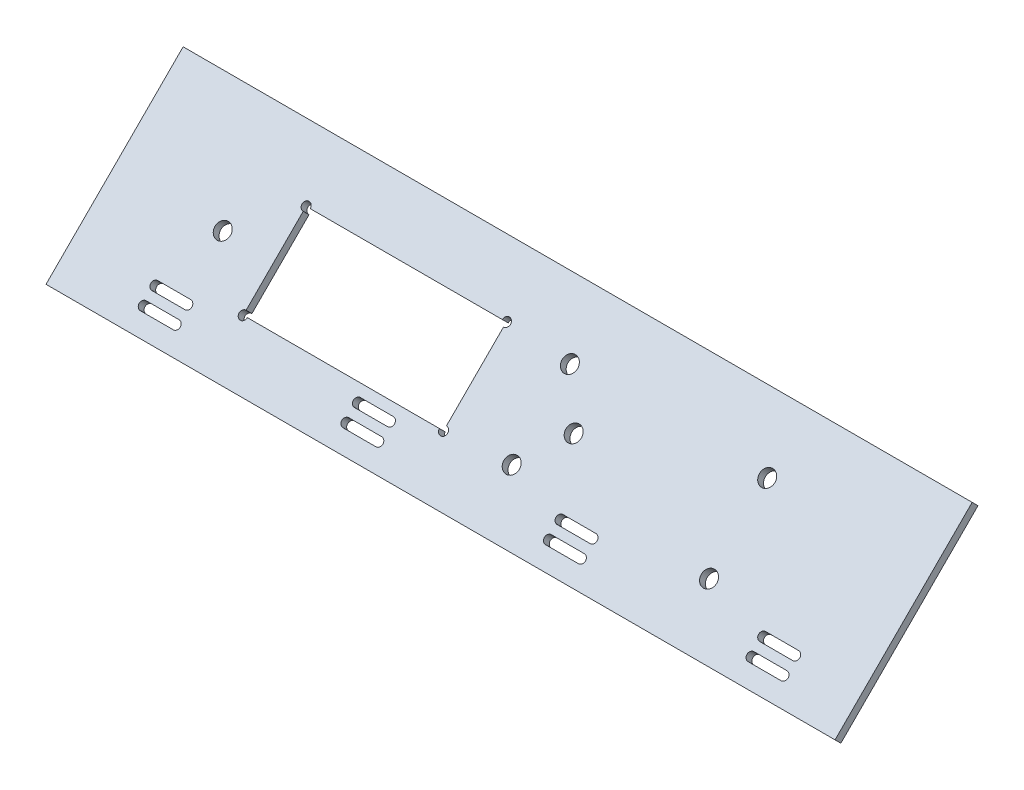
ISO-10303-21;
HEADER;
FILE_DESCRIPTION(('STEP AP214'),'2;1');
FILE_NAME('part.step','',(''),(''),'','','');
FILE_SCHEMA(('AUTOMOTIVE_DESIGN { 1 0 10303 214 1 1 1 1 }'));
ENDSEC;
DATA;
#1=APPLICATION_CONTEXT('core data for automotive mechanical design processes');
#2=APPLICATION_PROTOCOL_DEFINITION('international standard','automotive_design',2000,#1);
#3=PRODUCT_CONTEXT('',#1,'mechanical');
#4=PRODUCT('Part','Part','',(#3));
#5=PRODUCT_RELATED_PRODUCT_CATEGORY('part','',(#4));
#6=PRODUCT_DEFINITION_FORMATION('','',#4);
#7=PRODUCT_DEFINITION_CONTEXT('part definition',#1,'design');
#8=PRODUCT_DEFINITION('design','',#6,#7);
#9=PRODUCT_DEFINITION_SHAPE('','',#8);
#10=(LENGTH_UNIT() NAMED_UNIT(*) SI_UNIT(.MILLI.,.METRE.));
#11=(NAMED_UNIT(*) PLANE_ANGLE_UNIT() SI_UNIT($,.RADIAN.));
#12=(NAMED_UNIT(*) SI_UNIT($,.STERADIAN.) SOLID_ANGLE_UNIT());
#13=UNCERTAINTY_MEASURE_WITH_UNIT(LENGTH_MEASURE(1.E-05),#10,'distance_accuracy_value','');
#14=(GEOMETRIC_REPRESENTATION_CONTEXT(3) GLOBAL_UNCERTAINTY_ASSIGNED_CONTEXT((#13)) GLOBAL_UNIT_ASSIGNED_CONTEXT((#10,
#11,#12)) REPRESENTATION_CONTEXT('',''));
#15=CARTESIAN_POINT('',(0.,0.,0.));
#16=DIRECTION('',(0.,0.,1.));
#17=DIRECTION('',(1.,0.,0.));
#18=AXIS2_PLACEMENT_3D('',#15,#16,#17);
#19=CARTESIAN_POINT('',(-3.18981645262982E-13,876.503265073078,876.503265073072));
#20=DIRECTION('',(0.,0.70710678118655,0.707106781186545));
#21=DIRECTION('',(0.,-0.707106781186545,0.70710678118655));
#22=AXIS2_PLACEMENT_3D('',#19,#20,#21);
#23=PLANE('',#22);
#24=CARTESIAN_POINT('',(-849.921620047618,367.616923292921,1385.38960685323));
#25=DIRECTION('',(0.,0.70710678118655,0.707106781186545));
#26=DIRECTION('',(0.,-0.707106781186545,0.70710678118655));
#27=AXIS2_PLACEMENT_3D('',#24,#25,#26);
#28=CIRCLE('',#27,1.58749999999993);
#29=CARTESIAN_POINT('',(-849.921620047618,368.739455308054,1384.2670748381));
#30=VERTEX_POINT('',#29);
#31=CARTESIAN_POINT('',(-848.334120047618,367.616923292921,1385.38960685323));
#32=VERTEX_POINT('',#31);
#33=EDGE_CURVE('E328',#30,#32,#28,.T.);
#34=ORIENTED_EDGE('',*,*,#33,.F.);
#35=DIRECTION('',(0.,-0.707106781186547,0.707106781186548));
#36=VECTOR('',#35,1.);
#37=CARTESIAN_POINT('',(-849.921620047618,391.906041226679,1361.10048891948));
#38=LINE('',#37,#36);
#39=CARTESIAN_POINT('',(-849.921620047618,390.783509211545,1362.22302093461));
#40=VERTEX_POINT('',#39);
#41=EDGE_CURVE('E351',#40,#30,#38,.T.);
#42=ORIENTED_EDGE('',*,*,#41,.F.);
#43=CARTESIAN_POINT('',(-849.921620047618,391.906041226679,1361.10048891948));
#44=DIRECTION('',(0.,0.70710678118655,0.707106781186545));
#45=DIRECTION('',(0.,-0.707106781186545,0.70710678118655));
#46=AXIS2_PLACEMENT_3D('',#43,#44,#45);
#47=CIRCLE('',#46,1.58749999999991);
#48=CARTESIAN_POINT('',(-848.334120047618,391.906041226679,1361.10048891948));
#49=VERTEX_POINT('',#48);
#50=EDGE_CURVE('E707',#49,#40,#47,.T.);
#51=ORIENTED_EDGE('',*,*,#50,.F.);
#52=DIRECTION('',(-1.,0.,0.));
#53=VECTOR('',#52,1.);
#54=CARTESIAN_POINT('',(-849.921620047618,391.906041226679,1361.10048891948));
#55=LINE('',#54,#53);
#56=CARTESIAN_POINT('',(-774.159120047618,391.906041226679,1361.10048891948));
#57=VERTEX_POINT('',#56);
#58=EDGE_CURVE('E347',#57,#49,#55,.T.);
#59=ORIENTED_EDGE('',*,*,#58,.F.);
#60=CARTESIAN_POINT('',(-772.571620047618,391.906041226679,1361.10048891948));
#61=DIRECTION('',(0.,0.70710678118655,0.707106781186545));
#62=DIRECTION('',(0.,-0.707106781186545,0.70710678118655));
#63=AXIS2_PLACEMENT_3D('',#60,#61,#62);
#64=CIRCLE('',#63,1.58749999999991);
#65=CARTESIAN_POINT('',(-772.571620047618,390.783509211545,1362.22302093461));
#66=VERTEX_POINT('',#65);
#67=EDGE_CURVE('E329',#66,#57,#64,.T.);
#68=ORIENTED_EDGE('',*,*,#67,.F.);
#69=DIRECTION('',(0.,0.707106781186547,-0.707106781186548));
#70=VECTOR('',#69,1.);
#71=CARTESIAN_POINT('',(-772.571620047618,391.906041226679,1361.10048891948));
#72=LINE('',#71,#70);
#73=CARTESIAN_POINT('',(-772.571620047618,368.739455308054,1384.2670748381));
#74=VERTEX_POINT('',#73);
#75=EDGE_CURVE('E339',#74,#66,#72,.T.);
#76=ORIENTED_EDGE('',*,*,#75,.F.);
#77=CARTESIAN_POINT('',(-772.571620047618,367.616923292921,1385.38960685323));
#78=DIRECTION('',(0.,0.70710678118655,0.707106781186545));
#79=DIRECTION('',(0.,-0.707106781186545,0.70710678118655));
#80=AXIS2_PLACEMENT_3D('',#77,#78,#79);
#81=CIRCLE('',#80,1.58749999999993);
#82=CARTESIAN_POINT('',(-774.159120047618,367.616923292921,1385.38960685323));
#83=VERTEX_POINT('',#82);
#84=EDGE_CURVE('E318',#83,#74,#81,.T.);
#85=ORIENTED_EDGE('',*,*,#84,.F.);
#86=DIRECTION('',(1.,0.,0.));
#87=VECTOR('',#86,1.);
#88=CARTESIAN_POINT('',(-849.921620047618,367.616923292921,1385.38960685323));
#89=LINE('',#88,#87);
#90=EDGE_CURVE('E350',#32,#83,#89,.T.);
#91=ORIENTED_EDGE('',*,*,#90,.F.);
#92=EDGE_LOOP('',(#34,#42,#51,#59,#68,#76,#85,#91));
#93=FACE_BOUND('',#92,.T.);
#94=CARTESIAN_POINT('',(-747.171620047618,390.986802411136,1362.01972773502));
#95=DIRECTION('',(0.,0.707106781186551,0.707106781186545));
#96=DIRECTION('',(0.,-0.707106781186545,0.707106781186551));
#97=AXIS2_PLACEMENT_3D('',#94,#95,#96);
#98=CIRCLE('',#97,3.00000000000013);
#99=CARTESIAN_POINT('',(-747.171620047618,388.865482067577,1364.14104807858));
#100=VERTEX_POINT('',#99);
#101=EDGE_CURVE('E365',#100,#100,#98,.T.);
#102=ORIENTED_EDGE('',*,*,#101,.F.);
#103=EDGE_LOOP('',(#102));
#104=FACE_BOUND('',#103,.T.);
#105=CARTESIAN_POINT('',(-747.171620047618,368.536162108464,1384.47036803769));
#106=DIRECTION('',(0.,0.707106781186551,0.707106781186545));
#107=DIRECTION('',(0.,-0.707106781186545,0.707106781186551));
#108=AXIS2_PLACEMENT_3D('',#105,#106,#107);
#109=CIRCLE('',#108,3.00000000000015);
#110=CARTESIAN_POINT('',(-747.171620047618,366.414841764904,1386.59168838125));
#111=VERTEX_POINT('',#110);
#112=EDGE_CURVE('E376',#111,#111,#109,.T.);
#113=ORIENTED_EDGE('',*,*,#112,.F.);
#114=EDGE_LOOP('',(#113));
#115=FACE_BOUND('',#114,.T.);
#116=CARTESIAN_POINT('',(-670.971620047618,390.986802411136,1362.01972773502));
#117=DIRECTION('',(0.,0.707106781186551,0.707106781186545));
#118=DIRECTION('',(0.,-0.707106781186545,0.707106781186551));
#119=AXIS2_PLACEMENT_3D('',#116,#117,#118);
#120=CIRCLE('',#119,3.00000000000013);
#121=CARTESIAN_POINT('',(-670.971620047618,388.865482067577,1364.14104807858));
#122=VERTEX_POINT('',#121);
#123=EDGE_CURVE('E389',#122,#122,#120,.T.);
#124=ORIENTED_EDGE('',*,*,#123,.F.);
#125=EDGE_LOOP('',(#124));
#126=FACE_BOUND('',#125,.T.);
#127=DIRECTION('',(-1.,0.,0.));
#128=VECTOR('',#127,1.);
#129=CARTESIAN_POINT('',(-607.540370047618,406.702250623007,1346.30427952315));
#130=LINE('',#129,#128);
#131=CARTESIAN_POINT('',(-607.540370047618,406.702250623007,1346.30427952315));
#132=VERTEX_POINT('',#131);
#133=CARTESIAN_POINT('',(-912.202870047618,406.702250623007,1346.30427952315));
#134=VERTEX_POINT('',#133);
#135=EDGE_CURVE('E645',#132,#134,#130,.T.);
#136=ORIENTED_EDGE('',*,*,#135,.T.);
#137=DIRECTION('',(0.,-0.707106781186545,0.70710678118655));
#138=VECTOR('',#137,1.);
#139=CARTESIAN_POINT('',(-912.202870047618,406.702250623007,1346.30427952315));
#140=LINE('',#139,#138);
#141=CARTESIAN_POINT('',(-912.202870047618,353.750649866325,1399.25588027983));
#142=VERTEX_POINT('',#141);
#143=EDGE_CURVE('E642',#134,#142,#140,.T.);
#144=ORIENTED_EDGE('',*,*,#143,.T.);
#145=DIRECTION('',(1.,0.,0.));
#146=VECTOR('',#145,1.);
#147=CARTESIAN_POINT('',(-607.540370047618,353.750649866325,1399.25588027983));
#148=LINE('',#147,#146);
#149=CARTESIAN_POINT('',(-607.540370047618,353.750649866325,1399.25588027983));
#150=VERTEX_POINT('',#149);
#151=EDGE_CURVE('E648',#142,#150,#148,.T.);
#152=ORIENTED_EDGE('',*,*,#151,.T.);
#153=DIRECTION('',(0.,0.707106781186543,-0.707106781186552));
#154=VECTOR('',#153,1.);
#155=CARTESIAN_POINT('',(-607.540370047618,406.702250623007,1346.30427952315));
#156=LINE('',#155,#154);
#157=EDGE_CURVE('E649',#150,#132,#156,.T.);
#158=ORIENTED_EDGE('',*,*,#157,.T.);
#159=EDGE_LOOP('',(#136,#144,#152,#158));
#160=FACE_BOUND('',#159,.T.);
#161=DIRECTION('',(1.,0.,0.));
#162=VECTOR('',#161,1.);
#163=CARTESIAN_POINT('',(-880.452870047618,362.923502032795,1390.08302811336));
#164=LINE('',#163,#162);
#165=CARTESIAN_POINT('',(-880.452870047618,362.923502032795,1390.08302811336));
#166=VERTEX_POINT('',#165);
#167=CARTESIAN_POINT('',(-867.752870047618,362.923502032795,1390.08302811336));
#168=VERTEX_POINT('',#167);
#169=EDGE_CURVE('E615',#166,#168,#164,.T.);
#170=ORIENTED_EDGE('',*,*,#169,.F.);
#171=CARTESIAN_POINT('',(-880.452870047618,364.046034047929,1388.96049609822));
#172=DIRECTION('',(0.,0.707106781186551,0.707106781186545));
#173=DIRECTION('',(0.,-0.707106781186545,0.707106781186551));
#174=AXIS2_PLACEMENT_3D('',#171,#172,#173);
#175=CIRCLE('',#174,1.58750000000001);
#176=CARTESIAN_POINT('',(-880.452870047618,365.168566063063,1387.83796408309));
#177=VERTEX_POINT('',#176);
#178=EDGE_CURVE('E614',#177,#166,#175,.T.);
#179=ORIENTED_EDGE('',*,*,#178,.F.);
#180=DIRECTION('',(-1.,0.,0.));
#181=VECTOR('',#180,1.);
#182=CARTESIAN_POINT('',(-867.752870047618,365.168566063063,1387.83796408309));
#183=LINE('',#182,#181);
#184=CARTESIAN_POINT('',(-867.752870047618,365.168566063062,1387.83796408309));
#185=VERTEX_POINT('',#184);
#186=EDGE_CURVE('E618',#185,#177,#183,.T.);
#187=ORIENTED_EDGE('',*,*,#186,.F.);
#188=CARTESIAN_POINT('',(-867.752870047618,364.046034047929,1388.96049609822));
#189=DIRECTION('',(0.,0.707106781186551,0.707106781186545));
#190=DIRECTION('',(0.,-0.707106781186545,0.707106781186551));
#191=AXIS2_PLACEMENT_3D('',#188,#189,#190);
#192=CIRCLE('',#191,1.58750000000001);
#193=EDGE_CURVE('E616',#168,#185,#192,.T.);
#194=ORIENTED_EDGE('',*,*,#193,.F.);
#195=EDGE_LOOP('',(#170,#179,#187,#194));
#196=FACE_BOUND('',#195,.T.);
#197=DIRECTION('',(-1.,0.,0.));
#198=VECTOR('',#197,1.);
#199=CARTESIAN_POINT('',(-867.752870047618,360.678438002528,1392.32809214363));
#200=LINE('',#199,#198);
#201=CARTESIAN_POINT('',(-867.752870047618,360.678438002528,1392.32809214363));
#202=VERTEX_POINT('',#201);
#203=CARTESIAN_POINT('',(-880.452870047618,360.678438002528,1392.32809214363));
#204=VERTEX_POINT('',#203);
#205=EDGE_CURVE('E582',#202,#204,#200,.T.);
#206=ORIENTED_EDGE('',*,*,#205,.F.);
#207=CARTESIAN_POINT('',(-867.752870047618,359.555905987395,1393.45062415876));
#208=DIRECTION('',(0.,0.707106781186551,0.707106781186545));
#209=DIRECTION('',(0.,-0.707106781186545,0.707106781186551));
#210=AXIS2_PLACEMENT_3D('',#207,#208,#209);
#211=CIRCLE('',#210,1.58749999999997);
#212=CARTESIAN_POINT('',(-867.752870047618,358.433373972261,1394.57315617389));
#213=VERTEX_POINT('',#212);
#214=EDGE_CURVE('E577',#213,#202,#211,.T.);
#215=ORIENTED_EDGE('',*,*,#214,.F.);
#216=DIRECTION('',(1.,0.,0.));
#217=VECTOR('',#216,1.);
#218=CARTESIAN_POINT('',(-880.452870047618,358.433373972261,1394.57315617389));
#219=LINE('',#218,#217);
#220=CARTESIAN_POINT('',(-880.452870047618,358.433373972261,1394.57315617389));
#221=VERTEX_POINT('',#220);
#222=EDGE_CURVE('E586',#221,#213,#219,.T.);
#223=ORIENTED_EDGE('',*,*,#222,.F.);
#224=CARTESIAN_POINT('',(-880.452870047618,359.555905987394,1393.45062415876));
#225=DIRECTION('',(0.,0.707106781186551,0.707106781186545));
#226=DIRECTION('',(0.,-0.707106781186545,0.707106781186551));
#227=AXIS2_PLACEMENT_3D('',#224,#225,#226);
#228=CIRCLE('',#227,1.58749999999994);
#229=EDGE_CURVE('E584',#204,#221,#228,.T.);
#230=ORIENTED_EDGE('',*,*,#229,.F.);
#231=EDGE_LOOP('',(#206,#215,#223,#230));
#232=FACE_BOUND('',#231,.T.);
#233=DIRECTION('',(-1.,0.,0.));
#234=VECTOR('',#233,1.);
#235=CARTESIAN_POINT('',(-789.520870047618,360.678438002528,1392.32809214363));
#236=LINE('',#235,#234);
#237=CARTESIAN_POINT('',(-789.520870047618,360.678438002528,1392.32809214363));
#238=VERTEX_POINT('',#237);
#239=CARTESIAN_POINT('',(-802.220870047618,360.678438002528,1392.32809214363));
#240=VERTEX_POINT('',#239);
#241=EDGE_CURVE('E552',#238,#240,#236,.T.);
#242=ORIENTED_EDGE('',*,*,#241,.F.);
#243=CARTESIAN_POINT('',(-789.520870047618,359.555905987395,1393.45062415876));
#244=DIRECTION('',(0.,0.707106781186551,0.707106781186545));
#245=DIRECTION('',(0.,-0.707106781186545,0.707106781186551));
#246=AXIS2_PLACEMENT_3D('',#243,#244,#245);
#247=CIRCLE('',#246,1.58749999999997);
#248=CARTESIAN_POINT('',(-789.520870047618,358.433373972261,1394.57315617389));
#249=VERTEX_POINT('',#248);
#250=EDGE_CURVE('E548',#249,#238,#247,.T.);
#251=ORIENTED_EDGE('',*,*,#250,.F.);
#252=DIRECTION('',(1.,0.,0.));
#253=VECTOR('',#252,1.);
#254=CARTESIAN_POINT('',(-802.220870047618,358.433373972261,1394.57315617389));
#255=LINE('',#254,#253);
#256=CARTESIAN_POINT('',(-802.220870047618,358.433373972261,1394.57315617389));
#257=VERTEX_POINT('',#256);
#258=EDGE_CURVE('E556',#257,#249,#255,.T.);
#259=ORIENTED_EDGE('',*,*,#258,.F.);
#260=CARTESIAN_POINT('',(-802.220870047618,359.555905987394,1393.45062415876));
#261=DIRECTION('',(0.,0.707106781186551,0.707106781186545));
#262=DIRECTION('',(0.,-0.707106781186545,0.707106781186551));
#263=AXIS2_PLACEMENT_3D('',#260,#261,#262);
#264=CIRCLE('',#263,1.58749999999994);
#265=EDGE_CURVE('E551',#240,#257,#264,.T.);
#266=ORIENTED_EDGE('',*,*,#265,.F.);
#267=EDGE_LOOP('',(#242,#251,#259,#266));
#268=FACE_BOUND('',#267,.T.);
#269=DIRECTION('',(1.,0.,0.));
#270=VECTOR('',#269,1.);
#271=CARTESIAN_POINT('',(-802.220870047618,362.923502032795,1390.08302811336));
#272=LINE('',#271,#270);
#273=CARTESIAN_POINT('',(-802.220870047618,362.923502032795,1390.08302811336));
#274=VERTEX_POINT('',#273);
#275=CARTESIAN_POINT('',(-789.520870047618,362.923502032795,1390.08302811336));
#276=VERTEX_POINT('',#275);
#277=EDGE_CURVE('E517',#274,#276,#272,.T.);
#278=ORIENTED_EDGE('',*,*,#277,.F.);
#279=CARTESIAN_POINT('',(-802.220870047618,364.046034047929,1388.96049609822));
#280=DIRECTION('',(0.,0.707106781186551,0.707106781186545));
#281=DIRECTION('',(0.,-0.707106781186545,0.707106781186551));
#282=AXIS2_PLACEMENT_3D('',#279,#280,#281);
#283=CIRCLE('',#282,1.58750000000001);
#284=CARTESIAN_POINT('',(-802.220870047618,365.168566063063,1387.83796408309));
#285=VERTEX_POINT('',#284);
#286=EDGE_CURVE('E520',#285,#274,#283,.T.);
#287=ORIENTED_EDGE('',*,*,#286,.F.);
#288=DIRECTION('',(-1.,0.,0.));
#289=VECTOR('',#288,1.);
#290=CARTESIAN_POINT('',(-789.520870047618,365.168566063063,1387.83796408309));
#291=LINE('',#290,#289);
#292=CARTESIAN_POINT('',(-789.520870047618,365.168566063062,1387.83796408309));
#293=VERTEX_POINT('',#292);
#294=EDGE_CURVE('E528',#293,#285,#291,.T.);
#295=ORIENTED_EDGE('',*,*,#294,.F.);
#296=CARTESIAN_POINT('',(-789.520870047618,364.046034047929,1388.96049609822));
#297=DIRECTION('',(0.,0.707106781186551,0.707106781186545));
#298=DIRECTION('',(0.,-0.707106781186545,0.707106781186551));
#299=AXIS2_PLACEMENT_3D('',#296,#297,#298);
#300=CIRCLE('',#299,1.58750000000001);
#301=EDGE_CURVE('E525',#276,#293,#300,.T.);
#302=ORIENTED_EDGE('',*,*,#301,.F.);
#303=EDGE_LOOP('',(#278,#287,#295,#302));
#304=FACE_BOUND('',#303,.T.);
#305=DIRECTION('',(-1.,0.,0.));
#306=VECTOR('',#305,1.);
#307=CARTESIAN_POINT('',(-711.288870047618,365.168566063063,1387.83796408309));
#308=LINE('',#307,#306);
#309=CARTESIAN_POINT('',(-711.288870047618,365.168566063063,1387.83796408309));
#310=VERTEX_POINT('',#309);
#311=CARTESIAN_POINT('',(-723.988870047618,365.168566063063,1387.83796408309));
#312=VERTEX_POINT('',#311);
#313=EDGE_CURVE('E487',#310,#312,#308,.T.);
#314=ORIENTED_EDGE('',*,*,#313,.F.);
#315=CARTESIAN_POINT('',(-711.288870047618,364.046034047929,1388.96049609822));
#316=DIRECTION('',(0.,0.707106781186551,0.707106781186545));
#317=DIRECTION('',(0.,-0.707106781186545,0.707106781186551));
#318=AXIS2_PLACEMENT_3D('',#315,#316,#317);
#319=CIRCLE('',#318,1.58750000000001);
#320=CARTESIAN_POINT('',(-711.288870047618,362.923502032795,1390.08302811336));
#321=VERTEX_POINT('',#320);
#322=EDGE_CURVE('E490',#321,#310,#319,.T.);
#323=ORIENTED_EDGE('',*,*,#322,.F.);
#324=DIRECTION('',(1.,0.,0.));
#325=VECTOR('',#324,1.);
#326=CARTESIAN_POINT('',(-723.988870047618,362.923502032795,1390.08302811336));
#327=LINE('',#326,#325);
#328=CARTESIAN_POINT('',(-723.988870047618,362.923502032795,1390.08302811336));
#329=VERTEX_POINT('',#328);
#330=EDGE_CURVE('E494',#329,#321,#327,.T.);
#331=ORIENTED_EDGE('',*,*,#330,.F.);
#332=CARTESIAN_POINT('',(-723.988870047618,364.046034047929,1388.96049609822));
#333=DIRECTION('',(0.,0.707106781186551,0.707106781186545));
#334=DIRECTION('',(0.,-0.707106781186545,0.707106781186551));
#335=AXIS2_PLACEMENT_3D('',#332,#333,#334);
#336=CIRCLE('',#335,1.58750000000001);
#337=EDGE_CURVE('E495',#312,#329,#336,.T.);
#338=ORIENTED_EDGE('',*,*,#337,.F.);
#339=EDGE_LOOP('',(#314,#323,#331,#338));
#340=FACE_BOUND('',#339,.T.);
#341=DIRECTION('',(1.,0.,0.));
#342=VECTOR('',#341,1.);
#343=CARTESIAN_POINT('',(-723.988870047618,358.433373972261,1394.57315617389));
#344=LINE('',#343,#342);
#345=CARTESIAN_POINT('',(-723.988870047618,358.433373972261,1394.57315617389));
#346=VERTEX_POINT('',#345);
#347=CARTESIAN_POINT('',(-711.288870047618,358.433373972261,1394.57315617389));
#348=VERTEX_POINT('',#347);
#349=EDGE_CURVE('E456',#346,#348,#344,.T.);
#350=ORIENTED_EDGE('',*,*,#349,.F.);
#351=CARTESIAN_POINT('',(-723.988870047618,359.555905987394,1393.45062415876));
#352=DIRECTION('',(0.,0.707106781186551,0.707106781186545));
#353=DIRECTION('',(0.,-0.707106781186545,0.707106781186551));
#354=AXIS2_PLACEMENT_3D('',#351,#352,#353);
#355=CIRCLE('',#354,1.58749999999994);
#356=CARTESIAN_POINT('',(-723.988870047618,360.678438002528,1392.32809214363));
#357=VERTEX_POINT('',#356);
#358=EDGE_CURVE('E457',#357,#346,#355,.T.);
#359=ORIENTED_EDGE('',*,*,#358,.F.);
#360=DIRECTION('',(-1.,0.,0.));
#361=VECTOR('',#360,1.);
#362=CARTESIAN_POINT('',(-711.288870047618,360.678438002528,1392.32809214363));
#363=LINE('',#362,#361);
#364=CARTESIAN_POINT('',(-711.288870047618,360.678438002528,1392.32809214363));
#365=VERTEX_POINT('',#364);
#366=EDGE_CURVE('E463',#365,#357,#363,.T.);
#367=ORIENTED_EDGE('',*,*,#366,.F.);
#368=CARTESIAN_POINT('',(-711.288870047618,359.555905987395,1393.45062415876));
#369=DIRECTION('',(0.,0.707106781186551,0.707106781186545));
#370=DIRECTION('',(0.,-0.707106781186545,0.707106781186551));
#371=AXIS2_PLACEMENT_3D('',#368,#369,#370);
#372=CIRCLE('',#371,1.58749999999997);
#373=EDGE_CURVE('E464',#348,#365,#372,.T.);
#374=ORIENTED_EDGE('',*,*,#373,.F.);
#375=EDGE_LOOP('',(#350,#359,#367,#374));
#376=FACE_BOUND('',#375,.T.);
#377=DIRECTION('',(1.,0.,0.));
#378=VECTOR('',#377,1.);
#379=CARTESIAN_POINT('',(-645.756870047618,362.923502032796,1390.08302811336));
#380=LINE('',#379,#378);
#381=CARTESIAN_POINT('',(-645.756870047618,362.923502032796,1390.08302811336));
#382=VERTEX_POINT('',#381);
#383=CARTESIAN_POINT('',(-633.056870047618,362.923502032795,1390.08302811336));
#384=VERTEX_POINT('',#383);
#385=EDGE_CURVE('E430',#382,#384,#380,.T.);
#386=ORIENTED_EDGE('',*,*,#385,.F.);
#387=CARTESIAN_POINT('',(-645.756870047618,364.046034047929,1388.96049609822));
#388=DIRECTION('',(0.,0.707106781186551,0.707106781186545));
#389=DIRECTION('',(0.,-0.707106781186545,0.707106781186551));
#390=AXIS2_PLACEMENT_3D('',#387,#388,#389);
#391=CIRCLE('',#390,1.58749999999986);
#392=CARTESIAN_POINT('',(-645.756870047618,365.168566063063,1387.83796408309));
#393=VERTEX_POINT('',#392);
#394=EDGE_CURVE('E422',#393,#382,#391,.T.);
#395=ORIENTED_EDGE('',*,*,#394,.F.);
#396=DIRECTION('',(-1.,0.,0.));
#397=VECTOR('',#396,1.);
#398=CARTESIAN_POINT('',(-633.056870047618,365.168566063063,1387.83796408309));
#399=LINE('',#398,#397);
#400=CARTESIAN_POINT('',(-633.056870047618,365.168566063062,1387.83796408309));
#401=VERTEX_POINT('',#400);
#402=EDGE_CURVE('E433',#401,#393,#399,.T.);
#403=ORIENTED_EDGE('',*,*,#402,.F.);
#404=CARTESIAN_POINT('',(-633.056870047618,364.046034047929,1388.96049609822));
#405=DIRECTION('',(0.,0.707106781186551,0.707106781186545));
#406=DIRECTION('',(0.,-0.707106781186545,0.707106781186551));
#407=AXIS2_PLACEMENT_3D('',#404,#405,#406);
#408=CIRCLE('',#407,1.58750000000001);
#409=EDGE_CURVE('E429',#384,#401,#408,.T.);
#410=ORIENTED_EDGE('',*,*,#409,.F.);
#411=EDGE_LOOP('',(#386,#395,#403,#410));
#412=FACE_BOUND('',#411,.T.);
#413=DIRECTION('',(-1.,0.,0.));
#414=VECTOR('',#413,1.);
#415=CARTESIAN_POINT('',(-633.056870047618,360.678438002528,1392.32809214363));
#416=LINE('',#415,#414);
#417=CARTESIAN_POINT('',(-633.056870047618,360.678438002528,1392.32809214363));
#418=VERTEX_POINT('',#417);
#419=CARTESIAN_POINT('',(-645.756870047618,360.678438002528,1392.32809214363));
#420=VERTEX_POINT('',#419);
#421=EDGE_CURVE('E396',#418,#420,#416,.T.);
#422=ORIENTED_EDGE('',*,*,#421,.F.);
#423=CARTESIAN_POINT('',(-633.056870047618,359.555905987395,1393.45062415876));
#424=DIRECTION('',(0.,0.707106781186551,0.707106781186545));
#425=DIRECTION('',(0.,-0.707106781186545,0.707106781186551));
#426=AXIS2_PLACEMENT_3D('',#423,#424,#425);
#427=CIRCLE('',#426,1.58750000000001);
#428=CARTESIAN_POINT('',(-633.056870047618,358.433373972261,1394.57315617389));
#429=VERTEX_POINT('',#428);
#430=EDGE_CURVE('E393',#429,#418,#427,.T.);
#431=ORIENTED_EDGE('',*,*,#430,.F.);
#432=DIRECTION('',(1.,0.,0.));
#433=VECTOR('',#432,1.);
#434=CARTESIAN_POINT('',(-645.756870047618,358.433373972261,1394.57315617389));
#435=LINE('',#434,#433);
#436=CARTESIAN_POINT('',(-645.756870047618,358.433373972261,1394.57315617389));
#437=VERTEX_POINT('',#436);
#438=EDGE_CURVE('E405',#437,#429,#435,.T.);
#439=ORIENTED_EDGE('',*,*,#438,.F.);
#440=CARTESIAN_POINT('',(-645.756870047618,359.555905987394,1393.45062415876));
#441=DIRECTION('',(0.,0.707106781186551,0.707106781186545));
#442=DIRECTION('',(0.,-0.707106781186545,0.707106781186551));
#443=AXIS2_PLACEMENT_3D('',#440,#441,#442);
#444=CIRCLE('',#443,1.58749999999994);
#445=EDGE_CURVE('E398',#420,#437,#444,.T.);
#446=ORIENTED_EDGE('',*,*,#445,.F.);
#447=EDGE_LOOP('',(#422,#431,#439,#446));
#448=FACE_BOUND('',#447,.T.);
#449=CARTESIAN_POINT('',(-670.971620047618,368.536162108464,1384.47036803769));
#450=DIRECTION('',(0.,0.707106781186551,0.707106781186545));
#451=DIRECTION('',(0.,-0.707106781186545,0.707106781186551));
#452=AXIS2_PLACEMENT_3D('',#449,#450,#451);
#453=CIRCLE('',#452,3.00000000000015);
#454=CARTESIAN_POINT('',(-670.971620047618,366.414841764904,1386.59168838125));
#455=VERTEX_POINT('',#454);
#456=EDGE_CURVE('E385',#455,#455,#453,.T.);
#457=ORIENTED_EDGE('',*,*,#456,.F.);
#458=EDGE_LOOP('',(#457));
#459=FACE_BOUND('',#458,.T.);
#460=CARTESIAN_POINT('',(-734.471620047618,379.7614822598,1373.24504788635));
#461=DIRECTION('',(0.,0.707106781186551,0.707106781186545));
#462=DIRECTION('',(0.,-0.707106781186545,0.707106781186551));
#463=AXIS2_PLACEMENT_3D('',#460,#461,#462);
#464=CIRCLE('',#463,3.00000000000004);
#465=CARTESIAN_POINT('',(-734.471620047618,377.64016191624,1375.36636822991));
#466=VERTEX_POINT('',#465);
#467=EDGE_CURVE('E367',#466,#466,#464,.T.);
#468=ORIENTED_EDGE('',*,*,#467,.F.);
#469=EDGE_LOOP('',(#468));
#470=FACE_BOUND('',#469,.T.);
#471=CARTESIAN_POINT('',(-869.971620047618,379.7614822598,1373.24504788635));
#472=DIRECTION('',(0.,0.707106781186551,0.707106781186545));
#473=DIRECTION('',(0.,-0.707106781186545,0.707106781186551));
#474=AXIS2_PLACEMENT_3D('',#471,#472,#473);
#475=CIRCLE('',#474,3.00000000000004);
#476=CARTESIAN_POINT('',(-869.971620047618,377.64016191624,1375.36636822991));
#477=VERTEX_POINT('',#476);
#478=EDGE_CURVE('E359',#477,#477,#475,.T.);
#479=ORIENTED_EDGE('',*,*,#478,.F.);
#480=EDGE_LOOP('',(#479));
#481=FACE_BOUND('',#480,.T.);
#482=ADVANCED_FACE('F39',(#93,#104,#115,#126,#160,#196,#232,#268,#304,#340,#376,#412,#448,#459,
#470,#481),#23,.T.);
#483=CARTESIAN_POINT('',(-3.18589122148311E-13,874.258201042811,874.258201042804));
#484=DIRECTION('',(0.,0.70710678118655,0.707106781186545));
#485=DIRECTION('',(0.,-0.707106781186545,0.70710678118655));
#486=AXIS2_PLACEMENT_3D('',#483,#484,#485);
#487=PLANE('',#486);
#488=DIRECTION('',(0.,-0.707106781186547,0.707106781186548));
#489=VECTOR('',#488,1.);
#490=CARTESIAN_POINT('',(-849.921620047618,389.660977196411,1358.85542488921));
#491=LINE('',#490,#489);
#492=CARTESIAN_POINT('',(-849.921620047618,388.538445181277,1359.97795690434));
#493=VERTEX_POINT('',#492);
#494=CARTESIAN_POINT('',(-849.921620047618,366.494391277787,1382.02201080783));
#495=VERTEX_POINT('',#494);
#496=EDGE_CURVE('E348',#493,#495,#491,.T.);
#497=ORIENTED_EDGE('',*,*,#496,.T.);
#498=CARTESIAN_POINT('',(-849.921620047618,365.371859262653,1383.14454282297));
#499=DIRECTION('',(0.,0.70710678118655,0.707106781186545));
#500=DIRECTION('',(0.,-0.707106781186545,0.70710678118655));
#501=AXIS2_PLACEMENT_3D('',#498,#499,#500);
#502=CIRCLE('',#501,1.58749999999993);
#503=CARTESIAN_POINT('',(-848.334120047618,365.371859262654,1383.14454282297));
#504=VERTEX_POINT('',#503);
#505=EDGE_CURVE('E338',#495,#504,#502,.T.);
#506=ORIENTED_EDGE('',*,*,#505,.T.);
#507=DIRECTION('',(1.,0.,0.));
#508=VECTOR('',#507,1.);
#509=CARTESIAN_POINT('',(-849.921620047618,365.371859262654,1383.14454282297));
#510=LINE('',#509,#508);
#511=CARTESIAN_POINT('',(-774.159120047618,365.371859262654,1383.14454282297));
#512=VERTEX_POINT('',#511);
#513=EDGE_CURVE('E684',#504,#512,#510,.T.);
#514=ORIENTED_EDGE('',*,*,#513,.T.);
#515=CARTESIAN_POINT('',(-772.571620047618,365.371859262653,1383.14454282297));
#516=DIRECTION('',(0.,0.70710678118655,0.707106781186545));
#517=DIRECTION('',(0.,-0.707106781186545,0.70710678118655));
#518=AXIS2_PLACEMENT_3D('',#515,#516,#517);
#519=CIRCLE('',#518,1.58749999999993);
#520=CARTESIAN_POINT('',(-772.571620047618,366.494391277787,1382.02201080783));
#521=VERTEX_POINT('',#520);
#522=EDGE_CURVE('E337',#512,#521,#519,.T.);
#523=ORIENTED_EDGE('',*,*,#522,.T.);
#524=DIRECTION('',(0.,0.707106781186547,-0.707106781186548));
#525=VECTOR('',#524,1.);
#526=CARTESIAN_POINT('',(-772.571620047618,389.660977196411,1358.85542488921));
#527=LINE('',#526,#525);
#528=CARTESIAN_POINT('',(-772.571620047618,388.538445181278,1359.97795690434));
#529=VERTEX_POINT('',#528);
#530=EDGE_CURVE('E340',#521,#529,#527,.T.);
#531=ORIENTED_EDGE('',*,*,#530,.T.);
#532=CARTESIAN_POINT('',(-772.571620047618,389.660977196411,1358.85542488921));
#533=DIRECTION('',(0.,0.70710678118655,0.707106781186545));
#534=DIRECTION('',(0.,-0.707106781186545,0.70710678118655));
#535=AXIS2_PLACEMENT_3D('',#532,#533,#534);
#536=CIRCLE('',#535,1.58749999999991);
#537=CARTESIAN_POINT('',(-774.159120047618,389.660977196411,1358.85542488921));
#538=VERTEX_POINT('',#537);
#539=EDGE_CURVE('E64',#529,#538,#536,.T.);
#540=ORIENTED_EDGE('',*,*,#539,.T.);
#541=DIRECTION('',(-1.,0.,0.));
#542=VECTOR('',#541,1.);
#543=CARTESIAN_POINT('',(-849.921620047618,389.660977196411,1358.85542488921));
#544=LINE('',#543,#542);
#545=CARTESIAN_POINT('',(-848.334120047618,389.660977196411,1358.85542488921));
#546=VERTEX_POINT('',#545);
#547=EDGE_CURVE('E361',#538,#546,#544,.T.);
#548=ORIENTED_EDGE('',*,*,#547,.T.);
#549=CARTESIAN_POINT('',(-849.921620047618,389.660977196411,1358.85542488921));
#550=DIRECTION('',(0.,0.70710678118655,0.707106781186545));
#551=DIRECTION('',(0.,-0.707106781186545,0.70710678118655));
#552=AXIS2_PLACEMENT_3D('',#549,#550,#551);
#553=CIRCLE('',#552,1.58749999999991);
#554=EDGE_CURVE('E53',#546,#493,#553,.T.);
#555=ORIENTED_EDGE('',*,*,#554,.T.);
#556=EDGE_LOOP('',(#497,#506,#514,#523,#531,#540,#548,#555));
#557=FACE_BOUND('',#556,.T.);
#558=CARTESIAN_POINT('',(-645.756870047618,361.800970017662,1386.71543206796));
#559=DIRECTION('',(0.,0.707106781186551,0.707106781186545));
#560=DIRECTION('',(0.,-0.707106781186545,0.707106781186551));
#561=AXIS2_PLACEMENT_3D('',#558,#559,#560);
#562=CIRCLE('',#561,1.58749999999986);
#563=CARTESIAN_POINT('',(-645.756870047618,362.923502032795,1385.59290005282));
#564=VERTEX_POINT('',#563);
#565=CARTESIAN_POINT('',(-645.756870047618,360.678438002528,1387.83796408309));
#566=VERTEX_POINT('',#565);
#567=EDGE_CURVE('E424',#564,#566,#562,.T.);
#568=ORIENTED_EDGE('',*,*,#567,.T.);
#569=DIRECTION('',(1.,0.,0.));
#570=VECTOR('',#569,1.);
#571=CARTESIAN_POINT('',(-645.756870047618,360.678438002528,1387.83796408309));
#572=LINE('',#571,#570);
#573=CARTESIAN_POINT('',(-633.056870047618,360.678438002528,1387.83796408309));
#574=VERTEX_POINT('',#573);
#575=EDGE_CURVE('E437',#566,#574,#572,.T.);
#576=ORIENTED_EDGE('',*,*,#575,.T.);
#577=CARTESIAN_POINT('',(-633.056870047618,361.800970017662,1386.71543206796));
#578=DIRECTION('',(0.,0.707106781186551,0.707106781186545));
#579=DIRECTION('',(0.,-0.707106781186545,0.707106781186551));
#580=AXIS2_PLACEMENT_3D('',#577,#578,#579);
#581=CIRCLE('',#580,1.58750000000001);
#582=CARTESIAN_POINT('',(-633.056870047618,362.923502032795,1385.59290005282));
#583=VERTEX_POINT('',#582);
#584=EDGE_CURVE('E442',#574,#583,#581,.T.);
#585=ORIENTED_EDGE('',*,*,#584,.T.);
#586=DIRECTION('',(-1.,0.,0.));
#587=VECTOR('',#586,1.);
#588=CARTESIAN_POINT('',(-633.056870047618,362.923502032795,1385.59290005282));
#589=LINE('',#588,#587);
#590=EDGE_CURVE('E428',#583,#564,#589,.T.);
#591=ORIENTED_EDGE('',*,*,#590,.T.);
#592=EDGE_LOOP('',(#568,#576,#585,#591));
#593=FACE_BOUND('',#592,.T.);
#594=CARTESIAN_POINT('',(-711.288870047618,361.800970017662,1386.71543206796));
#595=DIRECTION('',(0.,0.707106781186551,0.707106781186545));
#596=DIRECTION('',(0.,-0.707106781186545,0.707106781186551));
#597=AXIS2_PLACEMENT_3D('',#594,#595,#596);
#598=CIRCLE('',#597,1.58750000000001);
#599=CARTESIAN_POINT('',(-711.288870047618,360.678438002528,1387.83796408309));
#600=VERTEX_POINT('',#599);
#601=CARTESIAN_POINT('',(-711.288870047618,362.923502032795,1385.59290005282));
#602=VERTEX_POINT('',#601);
#603=EDGE_CURVE('E486',#600,#602,#598,.T.);
#604=ORIENTED_EDGE('',*,*,#603,.T.);
#605=DIRECTION('',(-1.,0.,0.));
#606=VECTOR('',#605,1.);
#607=CARTESIAN_POINT('',(-711.288870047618,362.923502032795,1385.59290005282));
#608=LINE('',#607,#606);
#609=CARTESIAN_POINT('',(-723.988870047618,362.923502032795,1385.59290005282));
#610=VERTEX_POINT('',#609);
#611=EDGE_CURVE('E498',#602,#610,#608,.T.);
#612=ORIENTED_EDGE('',*,*,#611,.T.);
#613=CARTESIAN_POINT('',(-723.988870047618,361.800970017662,1386.71543206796));
#614=DIRECTION('',(0.,0.707106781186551,0.707106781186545));
#615=DIRECTION('',(0.,-0.707106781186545,0.707106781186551));
#616=AXIS2_PLACEMENT_3D('',#613,#614,#615);
#617=CIRCLE('',#616,1.58750000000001);
#618=CARTESIAN_POINT('',(-723.988870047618,360.678438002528,1387.83796408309));
#619=VERTEX_POINT('',#618);
#620=EDGE_CURVE('E505',#610,#619,#617,.T.);
#621=ORIENTED_EDGE('',*,*,#620,.T.);
#622=DIRECTION('',(1.,0.,0.));
#623=VECTOR('',#622,1.);
#624=CARTESIAN_POINT('',(-723.988870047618,360.678438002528,1387.83796408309));
#625=LINE('',#624,#623);
#626=EDGE_CURVE('E489',#619,#600,#625,.T.);
#627=ORIENTED_EDGE('',*,*,#626,.T.);
#628=EDGE_LOOP('',(#604,#612,#621,#627));
#629=FACE_BOUND('',#628,.T.);
#630=CARTESIAN_POINT('',(-789.520870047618,357.310841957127,1391.20556012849));
#631=DIRECTION('',(0.,0.707106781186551,0.707106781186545));
#632=DIRECTION('',(0.,-0.707106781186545,0.707106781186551));
#633=AXIS2_PLACEMENT_3D('',#630,#631,#632);
#634=CIRCLE('',#633,1.58749999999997);
#635=CARTESIAN_POINT('',(-789.520870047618,356.188309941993,1392.32809214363));
#636=VERTEX_POINT('',#635);
#637=CARTESIAN_POINT('',(-789.520870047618,358.433373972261,1390.08302811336));
#638=VERTEX_POINT('',#637);
#639=EDGE_CURVE('E547',#636,#638,#634,.T.);
#640=ORIENTED_EDGE('',*,*,#639,.T.);
#641=DIRECTION('',(-1.,0.,0.));
#642=VECTOR('',#641,1.);
#643=CARTESIAN_POINT('',(-789.520870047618,358.433373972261,1390.08302811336));
#644=LINE('',#643,#642);
#645=CARTESIAN_POINT('',(-802.220870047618,358.433373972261,1390.08302811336));
#646=VERTEX_POINT('',#645);
#647=EDGE_CURVE('E565',#638,#646,#644,.T.);
#648=ORIENTED_EDGE('',*,*,#647,.T.);
#649=CARTESIAN_POINT('',(-802.220870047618,357.310841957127,1391.20556012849));
#650=DIRECTION('',(0.,0.707106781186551,0.707106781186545));
#651=DIRECTION('',(0.,-0.707106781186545,0.707106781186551));
#652=AXIS2_PLACEMENT_3D('',#649,#650,#651);
#653=CIRCLE('',#652,1.58749999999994);
#654=CARTESIAN_POINT('',(-802.220870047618,356.188309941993,1392.32809214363));
#655=VERTEX_POINT('',#654);
#656=EDGE_CURVE('E564',#646,#655,#653,.T.);
#657=ORIENTED_EDGE('',*,*,#656,.T.);
#658=DIRECTION('',(1.,0.,0.));
#659=VECTOR('',#658,1.);
#660=CARTESIAN_POINT('',(-802.220870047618,356.188309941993,1392.32809214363));
#661=LINE('',#660,#659);
#662=EDGE_CURVE('E555',#655,#636,#661,.T.);
#663=ORIENTED_EDGE('',*,*,#662,.T.);
#664=EDGE_LOOP('',(#640,#648,#657,#663));
#665=FACE_BOUND('',#664,.T.);
#666=CARTESIAN_POINT('',(-880.452870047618,361.800970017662,1386.71543206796));
#667=DIRECTION('',(0.,0.707106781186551,0.707106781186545));
#668=DIRECTION('',(0.,-0.707106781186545,0.707106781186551));
#669=AXIS2_PLACEMENT_3D('',#666,#667,#668);
#670=CIRCLE('',#669,1.58750000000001);
#671=CARTESIAN_POINT('',(-880.452870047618,362.923502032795,1385.59290005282));
#672=VERTEX_POINT('',#671);
#673=CARTESIAN_POINT('',(-880.452870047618,360.678438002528,1387.83796408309));
#674=VERTEX_POINT('',#673);
#675=EDGE_CURVE('E608',#672,#674,#670,.T.);
#676=ORIENTED_EDGE('',*,*,#675,.T.);
#677=DIRECTION('',(1.,0.,0.));
#678=VECTOR('',#677,1.);
#679=CARTESIAN_POINT('',(-880.452870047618,360.678438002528,1387.83796408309));
#680=LINE('',#679,#678);
#681=CARTESIAN_POINT('',(-867.752870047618,360.678438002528,1387.83796408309));
#682=VERTEX_POINT('',#681);
#683=EDGE_CURVE('E624',#674,#682,#680,.T.);
#684=ORIENTED_EDGE('',*,*,#683,.T.);
#685=CARTESIAN_POINT('',(-867.752870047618,361.800970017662,1386.71543206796));
#686=DIRECTION('',(0.,0.707106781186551,0.707106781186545));
#687=DIRECTION('',(0.,-0.707106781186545,0.707106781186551));
#688=AXIS2_PLACEMENT_3D('',#685,#686,#687);
#689=CIRCLE('',#688,1.58750000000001);
#690=CARTESIAN_POINT('',(-867.752870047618,362.923502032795,1385.59290005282));
#691=VERTEX_POINT('',#690);
#692=EDGE_CURVE('E626',#682,#691,#689,.T.);
#693=ORIENTED_EDGE('',*,*,#692,.T.);
#694=DIRECTION('',(-1.,0.,0.));
#695=VECTOR('',#694,1.);
#696=CARTESIAN_POINT('',(-867.752870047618,362.923502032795,1385.59290005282));
#697=LINE('',#696,#695);
#698=EDGE_CURVE('E613',#691,#672,#697,.T.);
#699=ORIENTED_EDGE('',*,*,#698,.T.);
#700=EDGE_LOOP('',(#676,#684,#693,#699));
#701=FACE_BOUND('',#700,.T.);
#702=DIRECTION('',(-1.,0.,0.));
#703=VECTOR('',#702,1.);
#704=CARTESIAN_POINT('',(-607.540370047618,404.45718659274,1344.05921549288));
#705=LINE('',#704,#703);
#706=CARTESIAN_POINT('',(-607.540370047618,404.45718659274,1344.05921549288));
#707=VERTEX_POINT('',#706);
#708=CARTESIAN_POINT('',(-912.202870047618,404.45718659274,1344.05921549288));
#709=VERTEX_POINT('',#708);
#710=EDGE_CURVE('E643',#707,#709,#705,.T.);
#711=ORIENTED_EDGE('',*,*,#710,.F.);
#712=DIRECTION('',(0.,0.707106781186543,-0.707106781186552));
#713=VECTOR('',#712,1.);
#714=CARTESIAN_POINT('',(-607.540370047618,404.45718659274,1344.05921549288));
#715=LINE('',#714,#713);
#716=CARTESIAN_POINT('',(-607.540370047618,351.505585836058,1397.01081624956));
#717=VERTEX_POINT('',#716);
#718=EDGE_CURVE('E646',#717,#707,#715,.T.);
#719=ORIENTED_EDGE('',*,*,#718,.F.);
#720=DIRECTION('',(1.,0.,0.));
#721=VECTOR('',#720,1.);
#722=CARTESIAN_POINT('',(-607.540370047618,351.505585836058,1397.01081624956));
#723=LINE('',#722,#721);
#724=CARTESIAN_POINT('',(-912.202870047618,351.505585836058,1397.01081624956));
#725=VERTEX_POINT('',#724);
#726=EDGE_CURVE('E660',#725,#717,#723,.T.);
#727=ORIENTED_EDGE('',*,*,#726,.F.);
#728=DIRECTION('',(0.,-0.707106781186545,0.70710678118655));
#729=VECTOR('',#728,1.);
#730=CARTESIAN_POINT('',(-912.202870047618,404.45718659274,1344.05921549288));
#731=LINE('',#730,#729);
#732=EDGE_CURVE('E654',#709,#725,#731,.T.);
#733=ORIENTED_EDGE('',*,*,#732,.F.);
#734=EDGE_LOOP('',(#711,#719,#727,#733));
#735=FACE_BOUND('',#734,.T.);
#736=CARTESIAN_POINT('',(-867.752870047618,357.310841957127,1391.20556012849));
#737=DIRECTION('',(0.,0.707106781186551,0.707106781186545));
#738=DIRECTION('',(0.,-0.707106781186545,0.707106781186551));
#739=AXIS2_PLACEMENT_3D('',#736,#737,#738);
#740=CIRCLE('',#739,1.58749999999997);
#741=CARTESIAN_POINT('',(-867.752870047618,356.188309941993,1392.32809214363));
#742=VERTEX_POINT('',#741);
#743=CARTESIAN_POINT('',(-867.752870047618,358.433373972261,1390.08302811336));
#744=VERTEX_POINT('',#743);
#745=EDGE_CURVE('E578',#742,#744,#740,.T.);
#746=ORIENTED_EDGE('',*,*,#745,.T.);
#747=DIRECTION('',(-1.,0.,0.));
#748=VECTOR('',#747,1.);
#749=CARTESIAN_POINT('',(-867.752870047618,358.433373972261,1390.08302811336));
#750=LINE('',#749,#748);
#751=CARTESIAN_POINT('',(-880.452870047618,358.433373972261,1390.08302811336));
#752=VERTEX_POINT('',#751);
#753=EDGE_CURVE('E593',#744,#752,#750,.T.);
#754=ORIENTED_EDGE('',*,*,#753,.T.);
#755=CARTESIAN_POINT('',(-880.452870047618,357.310841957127,1391.20556012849));
#756=DIRECTION('',(0.,0.707106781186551,0.707106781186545));
#757=DIRECTION('',(0.,-0.707106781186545,0.707106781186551));
#758=AXIS2_PLACEMENT_3D('',#755,#756,#757);
#759=CIRCLE('',#758,1.58749999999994);
#760=CARTESIAN_POINT('',(-880.452870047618,356.188309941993,1392.32809214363));
#761=VERTEX_POINT('',#760);
#762=EDGE_CURVE('E596',#752,#761,#759,.T.);
#763=ORIENTED_EDGE('',*,*,#762,.T.);
#764=DIRECTION('',(1.,0.,0.));
#765=VECTOR('',#764,1.);
#766=CARTESIAN_POINT('',(-880.452870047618,356.188309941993,1392.32809214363));
#767=LINE('',#766,#765);
#768=EDGE_CURVE('E581',#761,#742,#767,.T.);
#769=ORIENTED_EDGE('',*,*,#768,.T.);
#770=EDGE_LOOP('',(#746,#754,#763,#769));
#771=FACE_BOUND('',#770,.T.);
#772=CARTESIAN_POINT('',(-802.220870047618,361.800970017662,1386.71543206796));
#773=DIRECTION('',(0.,0.707106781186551,0.707106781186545));
#774=DIRECTION('',(0.,-0.707106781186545,0.707106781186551));
#775=AXIS2_PLACEMENT_3D('',#772,#773,#774);
#776=CIRCLE('',#775,1.58750000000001);
#777=CARTESIAN_POINT('',(-802.220870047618,362.923502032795,1385.59290005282));
#778=VERTEX_POINT('',#777);
#779=CARTESIAN_POINT('',(-802.220870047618,360.678438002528,1387.83796408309));
#780=VERTEX_POINT('',#779);
#781=EDGE_CURVE('E516',#778,#780,#776,.T.);
#782=ORIENTED_EDGE('',*,*,#781,.T.);
#783=DIRECTION('',(1.,0.,0.));
#784=VECTOR('',#783,1.);
#785=CARTESIAN_POINT('',(-802.220870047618,360.678438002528,1387.83796408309));
#786=LINE('',#785,#784);
#787=CARTESIAN_POINT('',(-789.520870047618,360.678438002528,1387.83796408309));
#788=VERTEX_POINT('',#787);
#789=EDGE_CURVE('E533',#780,#788,#786,.T.);
#790=ORIENTED_EDGE('',*,*,#789,.T.);
#791=CARTESIAN_POINT('',(-789.520870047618,361.800970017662,1386.71543206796));
#792=DIRECTION('',(0.,0.707106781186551,0.707106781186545));
#793=DIRECTION('',(0.,-0.707106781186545,0.707106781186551));
#794=AXIS2_PLACEMENT_3D('',#791,#792,#793);
#795=CIRCLE('',#794,1.58750000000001);
#796=CARTESIAN_POINT('',(-789.520870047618,362.923502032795,1385.59290005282));
#797=VERTEX_POINT('',#796);
#798=EDGE_CURVE('E534',#788,#797,#795,.T.);
#799=ORIENTED_EDGE('',*,*,#798,.T.);
#800=DIRECTION('',(-1.,0.,0.));
#801=VECTOR('',#800,1.);
#802=CARTESIAN_POINT('',(-789.520870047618,362.923502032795,1385.59290005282));
#803=LINE('',#802,#801);
#804=EDGE_CURVE('E524',#797,#778,#803,.T.);
#805=ORIENTED_EDGE('',*,*,#804,.T.);
#806=EDGE_LOOP('',(#782,#790,#799,#805));
#807=FACE_BOUND('',#806,.T.);
#808=CARTESIAN_POINT('',(-723.988870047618,357.310841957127,1391.20556012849));
#809=DIRECTION('',(0.,0.707106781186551,0.707106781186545));
#810=DIRECTION('',(0.,-0.707106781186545,0.707106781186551));
#811=AXIS2_PLACEMENT_3D('',#808,#809,#810);
#812=CIRCLE('',#811,1.58749999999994);
#813=CARTESIAN_POINT('',(-723.988870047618,358.433373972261,1390.08302811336));
#814=VERTEX_POINT('',#813);
#815=CARTESIAN_POINT('',(-723.988870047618,356.188309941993,1392.32809214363));
#816=VERTEX_POINT('',#815);
#817=EDGE_CURVE('E454',#814,#816,#812,.T.);
#818=ORIENTED_EDGE('',*,*,#817,.T.);
#819=DIRECTION('',(1.,0.,0.));
#820=VECTOR('',#819,1.);
#821=CARTESIAN_POINT('',(-723.988870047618,356.188309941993,1392.32809214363));
#822=LINE('',#821,#820);
#823=CARTESIAN_POINT('',(-711.288870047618,356.188309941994,1392.32809214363));
#824=VERTEX_POINT('',#823);
#825=EDGE_CURVE('E468',#816,#824,#822,.T.);
#826=ORIENTED_EDGE('',*,*,#825,.T.);
#827=CARTESIAN_POINT('',(-711.288870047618,357.310841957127,1391.20556012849));
#828=DIRECTION('',(0.,0.707106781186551,0.707106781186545));
#829=DIRECTION('',(0.,-0.707106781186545,0.707106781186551));
#830=AXIS2_PLACEMENT_3D('',#827,#828,#829);
#831=CIRCLE('',#830,1.58749999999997);
#832=CARTESIAN_POINT('',(-711.288870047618,358.433373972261,1390.08302811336));
#833=VERTEX_POINT('',#832);
#834=EDGE_CURVE('E472',#824,#833,#831,.T.);
#835=ORIENTED_EDGE('',*,*,#834,.T.);
#836=DIRECTION('',(-1.,0.,0.));
#837=VECTOR('',#836,1.);
#838=CARTESIAN_POINT('',(-711.288870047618,358.433373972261,1390.08302811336));
#839=LINE('',#838,#837);
#840=EDGE_CURVE('E459',#833,#814,#839,.T.);
#841=ORIENTED_EDGE('',*,*,#840,.T.);
#842=EDGE_LOOP('',(#818,#826,#835,#841));
#843=FACE_BOUND('',#842,.T.);
#844=CARTESIAN_POINT('',(-633.056870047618,357.310841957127,1391.20556012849));
#845=DIRECTION('',(0.,0.707106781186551,0.707106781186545));
#846=DIRECTION('',(0.,-0.707106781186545,0.707106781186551));
#847=AXIS2_PLACEMENT_3D('',#844,#845,#846);
#848=CIRCLE('',#847,1.58750000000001);
#849=CARTESIAN_POINT('',(-633.056870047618,356.188309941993,1392.32809214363));
#850=VERTEX_POINT('',#849);
#851=CARTESIAN_POINT('',(-633.056870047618,358.433373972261,1390.08302811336));
#852=VERTEX_POINT('',#851);
#853=EDGE_CURVE('E394',#850,#852,#848,.T.);
#854=ORIENTED_EDGE('',*,*,#853,.T.);
#855=DIRECTION('',(-1.,0.,0.));
#856=VECTOR('',#855,1.);
#857=CARTESIAN_POINT('',(-633.056870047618,358.433373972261,1390.08302811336));
#858=LINE('',#857,#856);
#859=CARTESIAN_POINT('',(-645.756870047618,358.433373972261,1390.08302811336));
#860=VERTEX_POINT('',#859);
#861=EDGE_CURVE('E406',#852,#860,#858,.T.);
#862=ORIENTED_EDGE('',*,*,#861,.T.);
#863=CARTESIAN_POINT('',(-645.756870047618,357.310841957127,1391.20556012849));
#864=DIRECTION('',(0.,0.707106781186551,0.707106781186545));
#865=DIRECTION('',(0.,-0.707106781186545,0.707106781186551));
#866=AXIS2_PLACEMENT_3D('',#863,#864,#865);
#867=CIRCLE('',#866,1.58749999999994);
#868=CARTESIAN_POINT('',(-645.756870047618,356.188309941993,1392.32809214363));
#869=VERTEX_POINT('',#868);
#870=EDGE_CURVE('E407',#860,#869,#867,.T.);
#871=ORIENTED_EDGE('',*,*,#870,.T.);
#872=DIRECTION('',(1.,0.,0.));
#873=VECTOR('',#872,1.);
#874=CARTESIAN_POINT('',(-645.756870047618,356.188309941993,1392.32809214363));
#875=LINE('',#874,#873);
#876=EDGE_CURVE('E400',#869,#850,#875,.T.);
#877=ORIENTED_EDGE('',*,*,#876,.T.);
#878=EDGE_LOOP('',(#854,#862,#871,#877));
#879=FACE_BOUND('',#878,.T.);
#880=CARTESIAN_POINT('',(-670.971620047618,388.741738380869,1359.77466370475));
#881=DIRECTION('',(0.,0.707106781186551,0.707106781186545));
#882=DIRECTION('',(0.,-0.707106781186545,0.707106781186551));
#883=AXIS2_PLACEMENT_3D('',#880,#881,#882);
#884=CIRCLE('',#883,3.00000000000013);
#885=CARTESIAN_POINT('',(-670.971620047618,386.620418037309,1361.89598404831));
#886=VERTEX_POINT('',#885);
#887=EDGE_CURVE('E384',#886,#886,#884,.T.);
#888=ORIENTED_EDGE('',*,*,#887,.T.);
#889=EDGE_LOOP('',(#888));
#890=FACE_BOUND('',#889,.T.);
#891=CARTESIAN_POINT('',(-670.971620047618,366.291098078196,1382.22530400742));
#892=DIRECTION('',(0.,0.707106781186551,0.707106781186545));
#893=DIRECTION('',(0.,-0.707106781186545,0.707106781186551));
#894=AXIS2_PLACEMENT_3D('',#891,#892,#893);
#895=CIRCLE('',#894,3.00000000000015);
#896=CARTESIAN_POINT('',(-670.971620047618,364.169777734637,1384.34662435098));
#897=VERTEX_POINT('',#896);
#898=EDGE_CURVE('E377',#897,#897,#895,.T.);
#899=ORIENTED_EDGE('',*,*,#898,.T.);
#900=EDGE_LOOP('',(#899));
#901=FACE_BOUND('',#900,.T.);
#902=CARTESIAN_POINT('',(-747.171620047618,366.291098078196,1382.22530400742));
#903=DIRECTION('',(0.,0.707106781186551,0.707106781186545));
#904=DIRECTION('',(0.,-0.707106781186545,0.707106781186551));
#905=AXIS2_PLACEMENT_3D('',#902,#903,#904);
#906=CIRCLE('',#905,3.00000000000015);
#907=CARTESIAN_POINT('',(-747.171620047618,364.169777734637,1384.34662435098));
#908=VERTEX_POINT('',#907);
#909=EDGE_CURVE('E373',#908,#908,#906,.T.);
#910=ORIENTED_EDGE('',*,*,#909,.T.);
#911=EDGE_LOOP('',(#910));
#912=FACE_BOUND('',#911,.T.);
#913=CARTESIAN_POINT('',(-734.471620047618,377.516418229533,1370.99998385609));
#914=DIRECTION('',(0.,0.707106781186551,0.707106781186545));
#915=DIRECTION('',(0.,-0.707106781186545,0.707106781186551));
#916=AXIS2_PLACEMENT_3D('',#913,#914,#915);
#917=CIRCLE('',#916,3.00000000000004);
#918=CARTESIAN_POINT('',(-734.471620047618,375.395097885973,1373.12130419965));
#919=VERTEX_POINT('',#918);
#920=EDGE_CURVE('E370',#919,#919,#917,.T.);
#921=ORIENTED_EDGE('',*,*,#920,.T.);
#922=EDGE_LOOP('',(#921));
#923=FACE_BOUND('',#922,.T.);
#924=CARTESIAN_POINT('',(-747.171620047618,388.741738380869,1359.77466370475));
#925=DIRECTION('',(0.,0.707106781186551,0.707106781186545));
#926=DIRECTION('',(0.,-0.707106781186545,0.707106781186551));
#927=AXIS2_PLACEMENT_3D('',#924,#925,#926);
#928=CIRCLE('',#927,3.00000000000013);
#929=CARTESIAN_POINT('',(-747.171620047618,386.620418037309,1361.89598404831));
#930=VERTEX_POINT('',#929);
#931=EDGE_CURVE('E358',#930,#930,#928,.T.);
#932=ORIENTED_EDGE('',*,*,#931,.T.);
#933=EDGE_LOOP('',(#932));
#934=FACE_BOUND('',#933,.T.);
#935=CARTESIAN_POINT('',(-869.971620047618,377.516418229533,1370.99998385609));
#936=DIRECTION('',(0.,0.707106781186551,0.707106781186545));
#937=DIRECTION('',(0.,-0.707106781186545,0.707106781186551));
#938=AXIS2_PLACEMENT_3D('',#935,#936,#937);
#939=CIRCLE('',#938,3.00000000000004);
#940=CARTESIAN_POINT('',(-869.971620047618,375.395097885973,1373.12130419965));
#941=VERTEX_POINT('',#940);
#942=EDGE_CURVE('E357',#941,#941,#939,.T.);
#943=ORIENTED_EDGE('',*,*,#942,.T.);
#944=EDGE_LOOP('',(#943));
#945=FACE_BOUND('',#944,.T.);
#946=ADVANCED_FACE('F677',(#557,#593,#629,#665,#701,#735,#771,#807,#843,#879,#890,#901,#912,
#923,#934,#945),#487,.F.);
#947=CARTESIAN_POINT('',(-607.540370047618,406.702250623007,1346.30427952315));
#948=DIRECTION('',(0.,-0.707106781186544,0.70710678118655));
#949=DIRECTION('',(0.,-0.707106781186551,-0.707106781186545));
#950=AXIS2_PLACEMENT_3D('',#947,#948,#949);
#951=PLANE('',#950);
#952=ORIENTED_EDGE('',*,*,#710,.T.);
#953=DIRECTION('',(0.,-0.70710678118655,-0.707106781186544));
#954=VECTOR('',#953,1.);
#955=CARTESIAN_POINT('',(-912.202870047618,406.702250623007,1346.30427952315));
#956=LINE('',#955,#954);
#957=EDGE_CURVE('E670',#134,#709,#956,.T.);
#958=ORIENTED_EDGE('',*,*,#957,.F.);
#959=ORIENTED_EDGE('',*,*,#135,.F.);
#960=DIRECTION('',(0.,-0.70710678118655,-0.707106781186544));
#961=VECTOR('',#960,1.);
#962=CARTESIAN_POINT('',(-607.540370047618,406.702250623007,1346.30427952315));
#963=LINE('',#962,#961);
#964=EDGE_CURVE('E655',#132,#707,#963,.T.);
#965=ORIENTED_EDGE('',*,*,#964,.T.);
#966=EDGE_LOOP('',(#952,#958,#959,#965));
#967=FACE_BOUND('',#966,.T.);
#968=ADVANCED_FACE('F41',(#967),#951,.F.);
#969=CARTESIAN_POINT('',(-912.202870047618,406.702250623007,1346.30427952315));
#970=DIRECTION('',(1.,0.,0.));
#971=DIRECTION('',(0.,1.,0.));
#972=AXIS2_PLACEMENT_3D('',#969,#970,#971);
#973=PLANE('',#972);
#974=ORIENTED_EDGE('',*,*,#732,.T.);
#975=DIRECTION('',(0.,-0.70710678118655,-0.707106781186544));
#976=VECTOR('',#975,1.);
#977=CARTESIAN_POINT('',(-912.202870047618,353.750649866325,1399.25588027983));
#978=LINE('',#977,#976);
#979=EDGE_CURVE('E663',#142,#725,#978,.T.);
#980=ORIENTED_EDGE('',*,*,#979,.F.);
#981=ORIENTED_EDGE('',*,*,#143,.F.);
#982=ORIENTED_EDGE('',*,*,#957,.T.);
#983=EDGE_LOOP('',(#974,#980,#981,#982));
#984=FACE_BOUND('',#983,.T.);
#985=ADVANCED_FACE('F741',(#984),#973,.F.);
#986=CARTESIAN_POINT('',(-607.540370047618,353.750649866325,1399.25588027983));
#987=DIRECTION('',(0.,0.707106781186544,-0.70710678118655));
#988=DIRECTION('',(0.,0.707106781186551,0.707106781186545));
#989=AXIS2_PLACEMENT_3D('',#986,#987,#988);
#990=PLANE('',#989);
#991=ORIENTED_EDGE('',*,*,#726,.T.);
#992=DIRECTION('',(0.,-0.70710678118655,-0.707106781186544));
#993=VECTOR('',#992,1.);
#994=CARTESIAN_POINT('',(-607.540370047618,353.750649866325,1399.25588027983));
#995=LINE('',#994,#993);
#996=EDGE_CURVE('E665',#150,#717,#995,.T.);
#997=ORIENTED_EDGE('',*,*,#996,.F.);
#998=ORIENTED_EDGE('',*,*,#151,.F.);
#999=ORIENTED_EDGE('',*,*,#979,.T.);
#1000=EDGE_LOOP('',(#991,#997,#998,#999));
#1001=FACE_BOUND('',#1000,.T.);
#1002=ADVANCED_FACE('F738',(#1001),#990,.F.);
#1003=CARTESIAN_POINT('',(-607.540370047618,406.702250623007,1346.30427952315));
#1004=DIRECTION('',(-1.,0.,0.));
#1005=DIRECTION('',(0.,-1.,0.));
#1006=AXIS2_PLACEMENT_3D('',#1003,#1004,#1005);
#1007=PLANE('',#1006);
#1008=ORIENTED_EDGE('',*,*,#718,.T.);
#1009=ORIENTED_EDGE('',*,*,#964,.F.);
#1010=ORIENTED_EDGE('',*,*,#157,.F.);
#1011=ORIENTED_EDGE('',*,*,#996,.T.);
#1012=EDGE_LOOP('',(#1008,#1009,#1010,#1011));
#1013=FACE_BOUND('',#1012,.T.);
#1014=ADVANCED_FACE('F739',(#1013),#1007,.F.);
#1015=CARTESIAN_POINT('',(-880.452870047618,364.046034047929,1388.96049609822));
#1016=DIRECTION('',(0.,-0.70710678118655,-0.707106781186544));
#1017=DIRECTION('',(0.,0.707106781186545,-0.707106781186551));
#1018=AXIS2_PLACEMENT_3D('',#1015,#1016,#1017);
#1019=CYLINDRICAL_SURFACE('',#1018,1.58750000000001);
#1020=ORIENTED_EDGE('',*,*,#675,.F.);
#1021=DIRECTION('',(0.,-0.70710678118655,-0.707106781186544));
#1022=VECTOR('',#1021,1.);
#1023=CARTESIAN_POINT('',(-880.452870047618,365.168566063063,1387.83796408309));
#1024=LINE('',#1023,#1022);
#1025=EDGE_CURVE('E622',#177,#672,#1024,.T.);
#1026=ORIENTED_EDGE('',*,*,#1025,.F.);
#1027=ORIENTED_EDGE('',*,*,#178,.T.);
#1028=DIRECTION('',(0.,-0.70710678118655,-0.707106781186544));
#1029=VECTOR('',#1028,1.);
#1030=CARTESIAN_POINT('',(-880.452870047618,362.923502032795,1390.08302811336));
#1031=LINE('',#1030,#1029);
#1032=EDGE_CURVE('E636',#166,#674,#1031,.T.);
#1033=ORIENTED_EDGE('',*,*,#1032,.T.);
#1034=EDGE_LOOP('',(#1020,#1026,#1027,#1033));
#1035=FACE_BOUND('',#1034,.T.);
#1036=ADVANCED_FACE('F731',(#1035),#1019,.F.);
#1037=CARTESIAN_POINT('',(-880.452870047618,362.923502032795,1390.08302811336));
#1038=DIRECTION('',(0.,0.707106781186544,-0.70710678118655));
#1039=DIRECTION('',(0.,0.707106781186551,0.707106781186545));
#1040=AXIS2_PLACEMENT_3D('',#1037,#1038,#1039);
#1041=PLANE('',#1040);
#1042=ORIENTED_EDGE('',*,*,#683,.F.);
#1043=ORIENTED_EDGE('',*,*,#1032,.F.);
#1044=ORIENTED_EDGE('',*,*,#169,.T.);
#1045=DIRECTION('',(0.,-0.70710678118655,-0.707106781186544));
#1046=VECTOR('',#1045,1.);
#1047=CARTESIAN_POINT('',(-867.752870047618,362.923502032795,1390.08302811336));
#1048=LINE('',#1047,#1046);
#1049=EDGE_CURVE('E638',#168,#682,#1048,.T.);
#1050=ORIENTED_EDGE('',*,*,#1049,.T.);
#1051=EDGE_LOOP('',(#1042,#1043,#1044,#1050));
#1052=FACE_BOUND('',#1051,.T.);
#1053=ADVANCED_FACE('F952',(#1052),#1041,.T.);
#1054=CARTESIAN_POINT('',(-867.752870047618,364.046034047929,1388.96049609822));
#1055=DIRECTION('',(0.,-0.70710678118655,-0.707106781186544));
#1056=DIRECTION('',(0.,0.707106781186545,-0.707106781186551));
#1057=AXIS2_PLACEMENT_3D('',#1054,#1055,#1056);
#1058=CYLINDRICAL_SURFACE('',#1057,1.58750000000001);
#1059=ORIENTED_EDGE('',*,*,#692,.F.);
#1060=ORIENTED_EDGE('',*,*,#1049,.F.);
#1061=ORIENTED_EDGE('',*,*,#193,.T.);
#1062=DIRECTION('',(0.,-0.70710678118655,-0.707106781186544));
#1063=VECTOR('',#1062,1.);
#1064=CARTESIAN_POINT('',(-867.752870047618,365.168566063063,1387.83796408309));
#1065=LINE('',#1064,#1063);
#1066=EDGE_CURVE('E633',#185,#691,#1065,.T.);
#1067=ORIENTED_EDGE('',*,*,#1066,.T.);
#1068=EDGE_LOOP('',(#1059,#1060,#1061,#1067));
#1069=FACE_BOUND('',#1068,.T.);
#1070=ADVANCED_FACE('F947',(#1069),#1058,.F.);
#1071=CARTESIAN_POINT('',(-867.752870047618,365.168566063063,1387.83796408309));
#1072=DIRECTION('',(0.,-0.707106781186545,0.707106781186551));
#1073=DIRECTION('',(0.,-0.707106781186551,-0.707106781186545));
#1074=AXIS2_PLACEMENT_3D('',#1071,#1072,#1073);
#1075=PLANE('',#1074);
#1076=ORIENTED_EDGE('',*,*,#698,.F.);
#1077=ORIENTED_EDGE('',*,*,#1066,.F.);
#1078=ORIENTED_EDGE('',*,*,#186,.T.);
#1079=ORIENTED_EDGE('',*,*,#1025,.T.);
#1080=EDGE_LOOP('',(#1076,#1077,#1078,#1079));
#1081=FACE_BOUND('',#1080,.T.);
#1082=ADVANCED_FACE('F943',(#1081),#1075,.T.);
#1083=CARTESIAN_POINT('',(-867.752870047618,359.555905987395,1393.45062415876));
#1084=DIRECTION('',(0.,-0.70710678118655,-0.707106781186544));
#1085=DIRECTION('',(0.,0.707106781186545,-0.707106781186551));
#1086=AXIS2_PLACEMENT_3D('',#1083,#1084,#1085);
#1087=CYLINDRICAL_SURFACE('',#1086,1.58749999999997);
#1088=ORIENTED_EDGE('',*,*,#745,.F.);
#1089=DIRECTION('',(0.,-0.70710678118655,-0.707106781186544));
#1090=VECTOR('',#1089,1.);
#1091=CARTESIAN_POINT('',(-867.752870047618,358.433373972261,1394.57315617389));
#1092=LINE('',#1091,#1090);
#1093=EDGE_CURVE('E587',#213,#742,#1092,.T.);
#1094=ORIENTED_EDGE('',*,*,#1093,.F.);
#1095=ORIENTED_EDGE('',*,*,#214,.T.);
#1096=DIRECTION('',(0.,-0.70710678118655,-0.707106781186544));
#1097=VECTOR('',#1096,1.);
#1098=CARTESIAN_POINT('',(-867.752870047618,360.678438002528,1392.32809214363));
#1099=LINE('',#1098,#1097);
#1100=EDGE_CURVE('E610',#202,#744,#1099,.T.);
#1101=ORIENTED_EDGE('',*,*,#1100,.T.);
#1102=EDGE_LOOP('',(#1088,#1094,#1095,#1101));
#1103=FACE_BOUND('',#1102,.T.);
#1104=ADVANCED_FACE('F938',(#1103),#1087,.F.);
#1105=CARTESIAN_POINT('',(-867.752870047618,360.678438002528,1392.32809214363));
#1106=DIRECTION('',(0.,-0.707106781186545,0.707106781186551));
#1107=DIRECTION('',(0.,-0.707106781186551,-0.707106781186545));
#1108=AXIS2_PLACEMENT_3D('',#1105,#1106,#1107);
#1109=PLANE('',#1108);
#1110=ORIENTED_EDGE('',*,*,#753,.F.);
#1111=ORIENTED_EDGE('',*,*,#1100,.F.);
#1112=ORIENTED_EDGE('',*,*,#205,.T.);
#1113=DIRECTION('',(0.,-0.70710678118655,-0.707106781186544));
#1114=VECTOR('',#1113,1.);
#1115=CARTESIAN_POINT('',(-880.452870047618,360.678438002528,1392.32809214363));
#1116=LINE('',#1115,#1114);
#1117=EDGE_CURVE('E604',#204,#752,#1116,.T.);
#1118=ORIENTED_EDGE('',*,*,#1117,.T.);
#1119=EDGE_LOOP('',(#1110,#1111,#1112,#1118));
#1120=FACE_BOUND('',#1119,.T.);
#1121=ADVANCED_FACE('F937',(#1120),#1109,.T.);
#1122=CARTESIAN_POINT('',(-880.452870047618,359.555905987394,1393.45062415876));
#1123=DIRECTION('',(0.,-0.70710678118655,-0.707106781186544));
#1124=DIRECTION('',(0.,0.707106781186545,-0.707106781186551));
#1125=AXIS2_PLACEMENT_3D('',#1122,#1123,#1124);
#1126=CYLINDRICAL_SURFACE('',#1125,1.58749999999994);
#1127=ORIENTED_EDGE('',*,*,#762,.F.);
#1128=ORIENTED_EDGE('',*,*,#1117,.F.);
#1129=ORIENTED_EDGE('',*,*,#229,.T.);
#1130=DIRECTION('',(0.,-0.70710678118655,-0.707106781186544));
#1131=VECTOR('',#1130,1.);
#1132=CARTESIAN_POINT('',(-880.452870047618,358.433373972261,1394.57315617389));
#1133=LINE('',#1132,#1131);
#1134=EDGE_CURVE('E602',#221,#761,#1133,.T.);
#1135=ORIENTED_EDGE('',*,*,#1134,.T.);
#1136=EDGE_LOOP('',(#1127,#1128,#1129,#1135));
#1137=FACE_BOUND('',#1136,.T.);
#1138=ADVANCED_FACE('F935',(#1137),#1126,.F.);
#1139=CARTESIAN_POINT('',(-880.452870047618,358.433373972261,1394.57315617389));
#1140=DIRECTION('',(0.,0.707106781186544,-0.70710678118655));
#1141=DIRECTION('',(0.,0.707106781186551,0.707106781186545));
#1142=AXIS2_PLACEMENT_3D('',#1139,#1140,#1141);
#1143=PLANE('',#1142);
#1144=ORIENTED_EDGE('',*,*,#768,.F.);
#1145=ORIENTED_EDGE('',*,*,#1134,.F.);
#1146=ORIENTED_EDGE('',*,*,#222,.T.);
#1147=ORIENTED_EDGE('',*,*,#1093,.T.);
#1148=EDGE_LOOP('',(#1144,#1145,#1146,#1147));
#1149=FACE_BOUND('',#1148,.T.);
#1150=ADVANCED_FACE('F928',(#1149),#1143,.T.);
#1151=CARTESIAN_POINT('',(-789.520870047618,359.555905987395,1393.45062415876));
#1152=DIRECTION('',(0.,-0.70710678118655,-0.707106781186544));
#1153=DIRECTION('',(0.,0.707106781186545,-0.707106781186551));
#1154=AXIS2_PLACEMENT_3D('',#1151,#1152,#1153);
#1155=CYLINDRICAL_SURFACE('',#1154,1.58749999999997);
#1156=ORIENTED_EDGE('',*,*,#639,.F.);
#1157=DIRECTION('',(0.,-0.70710678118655,-0.707106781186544));
#1158=VECTOR('',#1157,1.);
#1159=CARTESIAN_POINT('',(-789.520870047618,358.433373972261,1394.57315617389));
#1160=LINE('',#1159,#1158);
#1161=EDGE_CURVE('E558',#249,#636,#1160,.T.);
#1162=ORIENTED_EDGE('',*,*,#1161,.F.);
#1163=ORIENTED_EDGE('',*,*,#250,.T.);
#1164=DIRECTION('',(0.,-0.70710678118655,-0.707106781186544));
#1165=VECTOR('',#1164,1.);
#1166=CARTESIAN_POINT('',(-789.520870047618,360.678438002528,1392.32809214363));
#1167=LINE('',#1166,#1165);
#1168=EDGE_CURVE('E579',#238,#638,#1167,.T.);
#1169=ORIENTED_EDGE('',*,*,#1168,.T.);
#1170=EDGE_LOOP('',(#1156,#1162,#1163,#1169));
#1171=FACE_BOUND('',#1170,.T.);
#1172=ADVANCED_FACE('F922',(#1171),#1155,.F.);
#1173=CARTESIAN_POINT('',(-789.520870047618,360.678438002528,1392.32809214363));
#1174=DIRECTION('',(0.,-0.707106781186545,0.707106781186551));
#1175=DIRECTION('',(0.,-0.707106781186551,-0.707106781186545));
#1176=AXIS2_PLACEMENT_3D('',#1173,#1174,#1175);
#1177=PLANE('',#1176);
#1178=ORIENTED_EDGE('',*,*,#647,.F.);
#1179=ORIENTED_EDGE('',*,*,#1168,.F.);
#1180=ORIENTED_EDGE('',*,*,#241,.T.);
#1181=DIRECTION('',(0.,-0.70710678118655,-0.707106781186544));
#1182=VECTOR('',#1181,1.);
#1183=CARTESIAN_POINT('',(-802.220870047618,360.678438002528,1392.32809214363));
#1184=LINE('',#1183,#1182);
#1185=EDGE_CURVE('E573',#240,#646,#1184,.T.);
#1186=ORIENTED_EDGE('',*,*,#1185,.T.);
#1187=EDGE_LOOP('',(#1178,#1179,#1180,#1186));
#1188=FACE_BOUND('',#1187,.T.);
#1189=ADVANCED_FACE('F917',(#1188),#1177,.T.);
#1190=CARTESIAN_POINT('',(-802.220870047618,359.555905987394,1393.45062415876));
#1191=DIRECTION('',(0.,-0.70710678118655,-0.707106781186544));
#1192=DIRECTION('',(0.,0.707106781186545,-0.707106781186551));
#1193=AXIS2_PLACEMENT_3D('',#1190,#1191,#1192);
#1194=CYLINDRICAL_SURFACE('',#1193,1.58749999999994);
#1195=ORIENTED_EDGE('',*,*,#656,.F.);
#1196=ORIENTED_EDGE('',*,*,#1185,.F.);
#1197=ORIENTED_EDGE('',*,*,#265,.T.);
#1198=DIRECTION('',(0.,-0.70710678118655,-0.707106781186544));
#1199=VECTOR('',#1198,1.);
#1200=CARTESIAN_POINT('',(-802.220870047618,358.433373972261,1394.57315617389));
#1201=LINE('',#1200,#1199);
#1202=EDGE_CURVE('E571',#257,#655,#1201,.T.);
#1203=ORIENTED_EDGE('',*,*,#1202,.T.);
#1204=EDGE_LOOP('',(#1195,#1196,#1197,#1203));
#1205=FACE_BOUND('',#1204,.T.);
#1206=ADVANCED_FACE('F918',(#1205),#1194,.F.);
#1207=CARTESIAN_POINT('',(-802.220870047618,358.433373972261,1394.57315617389));
#1208=DIRECTION('',(0.,0.707106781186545,-0.707106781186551));
#1209=DIRECTION('',(0.,0.707106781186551,0.707106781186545));
#1210=AXIS2_PLACEMENT_3D('',#1207,#1208,#1209);
#1211=PLANE('',#1210);
#1212=ORIENTED_EDGE('',*,*,#662,.F.);
#1213=ORIENTED_EDGE('',*,*,#1202,.F.);
#1214=ORIENTED_EDGE('',*,*,#258,.T.);
#1215=ORIENTED_EDGE('',*,*,#1161,.T.);
#1216=EDGE_LOOP('',(#1212,#1213,#1214,#1215));
#1217=FACE_BOUND('',#1216,.T.);
#1218=ADVANCED_FACE('F912',(#1217),#1211,.T.);
#1219=CARTESIAN_POINT('',(-802.220870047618,364.046034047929,1388.96049609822));
#1220=DIRECTION('',(0.,-0.70710678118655,-0.707106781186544));
#1221=DIRECTION('',(0.,0.707106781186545,-0.707106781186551));
#1222=AXIS2_PLACEMENT_3D('',#1219,#1220,#1221);
#1223=CYLINDRICAL_SURFACE('',#1222,1.58750000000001);
#1224=ORIENTED_EDGE('',*,*,#781,.F.);
#1225=DIRECTION('',(0.,-0.70710678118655,-0.707106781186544));
#1226=VECTOR('',#1225,1.);
#1227=CARTESIAN_POINT('',(-802.220870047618,365.168566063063,1387.83796408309));
#1228=LINE('',#1227,#1226);
#1229=EDGE_CURVE('E526',#285,#778,#1228,.T.);
#1230=ORIENTED_EDGE('',*,*,#1229,.F.);
#1231=ORIENTED_EDGE('',*,*,#286,.T.);
#1232=DIRECTION('',(0.,-0.70710678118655,-0.707106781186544));
#1233=VECTOR('',#1232,1.);
#1234=CARTESIAN_POINT('',(-802.220870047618,362.923502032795,1390.08302811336));
#1235=LINE('',#1234,#1233);
#1236=EDGE_CURVE('E544',#274,#780,#1235,.T.);
#1237=ORIENTED_EDGE('',*,*,#1236,.T.);
#1238=EDGE_LOOP('',(#1224,#1230,#1231,#1237));
#1239=FACE_BOUND('',#1238,.T.);
#1240=ADVANCED_FACE('F910',(#1239),#1223,.F.);
#1241=CARTESIAN_POINT('',(-802.220870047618,362.923502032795,1390.08302811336));
#1242=DIRECTION('',(0.,0.707106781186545,-0.707106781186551));
#1243=DIRECTION('',(0.,0.707106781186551,0.707106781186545));
#1244=AXIS2_PLACEMENT_3D('',#1241,#1242,#1243);
#1245=PLANE('',#1244);
#1246=ORIENTED_EDGE('',*,*,#789,.F.);
#1247=ORIENTED_EDGE('',*,*,#1236,.F.);
#1248=ORIENTED_EDGE('',*,*,#277,.T.);
#1249=DIRECTION('',(0.,-0.70710678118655,-0.707106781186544));
#1250=VECTOR('',#1249,1.);
#1251=CARTESIAN_POINT('',(-789.520870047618,362.923502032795,1390.08302811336));
#1252=LINE('',#1251,#1250);
#1253=EDGE_CURVE('E543',#276,#788,#1252,.T.);
#1254=ORIENTED_EDGE('',*,*,#1253,.T.);
#1255=EDGE_LOOP('',(#1246,#1247,#1248,#1254));
#1256=FACE_BOUND('',#1255,.T.);
#1257=ADVANCED_FACE('F903',(#1256),#1245,.T.);
#1258=CARTESIAN_POINT('',(-789.520870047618,364.046034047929,1388.96049609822));
#1259=DIRECTION('',(0.,-0.70710678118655,-0.707106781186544));
#1260=DIRECTION('',(0.,0.707106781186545,-0.707106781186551));
#1261=AXIS2_PLACEMENT_3D('',#1258,#1259,#1260);
#1262=CYLINDRICAL_SURFACE('',#1261,1.58750000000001);
#1263=ORIENTED_EDGE('',*,*,#798,.F.);
#1264=ORIENTED_EDGE('',*,*,#1253,.F.);
#1265=ORIENTED_EDGE('',*,*,#301,.T.);
#1266=DIRECTION('',(0.,-0.70710678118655,-0.707106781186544));
#1267=VECTOR('',#1266,1.);
#1268=CARTESIAN_POINT('',(-789.520870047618,365.168566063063,1387.83796408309));
#1269=LINE('',#1268,#1267);
#1270=EDGE_CURVE('E541',#293,#797,#1269,.T.);
#1271=ORIENTED_EDGE('',*,*,#1270,.T.);
#1272=EDGE_LOOP('',(#1263,#1264,#1265,#1271));
#1273=FACE_BOUND('',#1272,.T.);
#1274=ADVANCED_FACE('F898',(#1273),#1262,.F.);
#1275=CARTESIAN_POINT('',(-789.520870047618,365.168566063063,1387.83796408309));
#1276=DIRECTION('',(0.,-0.707106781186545,0.707106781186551));
#1277=DIRECTION('',(0.,-0.707106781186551,-0.707106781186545));
#1278=AXIS2_PLACEMENT_3D('',#1275,#1276,#1277);
#1279=PLANE('',#1278);
#1280=ORIENTED_EDGE('',*,*,#804,.F.);
#1281=ORIENTED_EDGE('',*,*,#1270,.F.);
#1282=ORIENTED_EDGE('',*,*,#294,.T.);
#1283=ORIENTED_EDGE('',*,*,#1229,.T.);
#1284=EDGE_LOOP('',(#1280,#1281,#1282,#1283));
#1285=FACE_BOUND('',#1284,.T.);
#1286=ADVANCED_FACE('F897',(#1285),#1279,.T.);
#1287=CARTESIAN_POINT('',(-711.288870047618,364.046034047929,1388.96049609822));
#1288=DIRECTION('',(0.,-0.70710678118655,-0.707106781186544));
#1289=DIRECTION('',(0.,0.707106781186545,-0.707106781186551));
#1290=AXIS2_PLACEMENT_3D('',#1287,#1288,#1289);
#1291=CYLINDRICAL_SURFACE('',#1290,1.58750000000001);
#1292=ORIENTED_EDGE('',*,*,#603,.F.);
#1293=DIRECTION('',(0.,-0.70710678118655,-0.707106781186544));
#1294=VECTOR('',#1293,1.);
#1295=CARTESIAN_POINT('',(-711.288870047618,362.923502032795,1390.08302811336));
#1296=LINE('',#1295,#1294);
#1297=EDGE_CURVE('E500',#321,#600,#1296,.T.);
#1298=ORIENTED_EDGE('',*,*,#1297,.F.);
#1299=ORIENTED_EDGE('',*,*,#322,.T.);
#1300=DIRECTION('',(0.,-0.70710678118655,-0.707106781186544));
#1301=VECTOR('',#1300,1.);
#1302=CARTESIAN_POINT('',(-711.288870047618,365.168566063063,1387.83796408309));
#1303=LINE('',#1302,#1301);
#1304=EDGE_CURVE('E514',#310,#602,#1303,.T.);
#1305=ORIENTED_EDGE('',*,*,#1304,.T.);
#1306=EDGE_LOOP('',(#1292,#1298,#1299,#1305));
#1307=FACE_BOUND('',#1306,.T.);
#1308=ADVANCED_FACE('F895',(#1307),#1291,.F.);
#1309=CARTESIAN_POINT('',(-711.288870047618,365.168566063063,1387.83796408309));
#1310=DIRECTION('',(0.,-0.707106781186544,0.70710678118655));
#1311=DIRECTION('',(0.,-0.707106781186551,-0.707106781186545));
#1312=AXIS2_PLACEMENT_3D('',#1309,#1310,#1311);
#1313=PLANE('',#1312);
#1314=ORIENTED_EDGE('',*,*,#611,.F.);
#1315=ORIENTED_EDGE('',*,*,#1304,.F.);
#1316=ORIENTED_EDGE('',*,*,#313,.T.);
#1317=DIRECTION('',(0.,-0.70710678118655,-0.707106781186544));
#1318=VECTOR('',#1317,1.);
#1319=CARTESIAN_POINT('',(-723.988870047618,365.168566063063,1387.83796408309));
#1320=LINE('',#1319,#1318);
#1321=EDGE_CURVE('E515',#312,#610,#1320,.T.);
#1322=ORIENTED_EDGE('',*,*,#1321,.T.);
#1323=EDGE_LOOP('',(#1314,#1315,#1316,#1322));
#1324=FACE_BOUND('',#1323,.T.);
#1325=ADVANCED_FACE('F890',(#1324),#1313,.T.);
#1326=CARTESIAN_POINT('',(-723.988870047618,364.046034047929,1388.96049609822));
#1327=DIRECTION('',(0.,-0.70710678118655,-0.707106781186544));
#1328=DIRECTION('',(0.,0.707106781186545,-0.707106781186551));
#1329=AXIS2_PLACEMENT_3D('',#1326,#1327,#1328);
#1330=CYLINDRICAL_SURFACE('',#1329,1.58750000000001);
#1331=ORIENTED_EDGE('',*,*,#620,.F.);
#1332=ORIENTED_EDGE('',*,*,#1321,.F.);
#1333=ORIENTED_EDGE('',*,*,#337,.T.);
#1334=DIRECTION('',(0.,-0.70710678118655,-0.707106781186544));
#1335=VECTOR('',#1334,1.);
#1336=CARTESIAN_POINT('',(-723.988870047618,362.923502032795,1390.08302811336));
#1337=LINE('',#1336,#1335);
#1338=EDGE_CURVE('E509',#329,#619,#1337,.T.);
#1339=ORIENTED_EDGE('',*,*,#1338,.T.);
#1340=EDGE_LOOP('',(#1331,#1332,#1333,#1339));
#1341=FACE_BOUND('',#1340,.T.);
#1342=ADVANCED_FACE('F881',(#1341),#1330,.F.);
#1343=CARTESIAN_POINT('',(-723.988870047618,362.923502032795,1390.08302811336));
#1344=DIRECTION('',(0.,0.707106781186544,-0.70710678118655));
#1345=DIRECTION('',(0.,0.707106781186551,0.707106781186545));
#1346=AXIS2_PLACEMENT_3D('',#1343,#1344,#1345);
#1347=PLANE('',#1346);
#1348=ORIENTED_EDGE('',*,*,#626,.F.);
#1349=ORIENTED_EDGE('',*,*,#1338,.F.);
#1350=ORIENTED_EDGE('',*,*,#330,.T.);
#1351=ORIENTED_EDGE('',*,*,#1297,.T.);
#1352=EDGE_LOOP('',(#1348,#1349,#1350,#1351));
#1353=FACE_BOUND('',#1352,.T.);
#1354=ADVANCED_FACE('F879',(#1353),#1347,.T.);
#1355=CARTESIAN_POINT('',(-723.988870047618,359.555905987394,1393.45062415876));
#1356=DIRECTION('',(0.,-0.70710678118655,-0.707106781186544));
#1357=DIRECTION('',(0.,0.707106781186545,-0.707106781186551));
#1358=AXIS2_PLACEMENT_3D('',#1355,#1356,#1357);
#1359=CYLINDRICAL_SURFACE('',#1358,1.58749999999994);
#1360=ORIENTED_EDGE('',*,*,#817,.F.);
#1361=DIRECTION('',(0.,-0.70710678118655,-0.707106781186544));
#1362=VECTOR('',#1361,1.);
#1363=CARTESIAN_POINT('',(-723.988870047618,360.678438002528,1392.32809214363));
#1364=LINE('',#1363,#1362);
#1365=EDGE_CURVE('E469',#357,#814,#1364,.T.);
#1366=ORIENTED_EDGE('',*,*,#1365,.F.);
#1367=ORIENTED_EDGE('',*,*,#358,.T.);
#1368=DIRECTION('',(0.,-0.70710678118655,-0.707106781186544));
#1369=VECTOR('',#1368,1.);
#1370=CARTESIAN_POINT('',(-723.988870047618,358.433373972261,1394.57315617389));
#1371=LINE('',#1370,#1369);
#1372=EDGE_CURVE('E483',#346,#816,#1371,.T.);
#1373=ORIENTED_EDGE('',*,*,#1372,.T.);
#1374=EDGE_LOOP('',(#1360,#1366,#1367,#1373));
#1375=FACE_BOUND('',#1374,.T.);
#1376=ADVANCED_FACE('F876',(#1375),#1359,.F.);
#1377=CARTESIAN_POINT('',(-723.988870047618,358.433373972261,1394.57315617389));
#1378=DIRECTION('',(0.,0.707106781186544,-0.70710678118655));
#1379=DIRECTION('',(0.,0.707106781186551,0.707106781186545));
#1380=AXIS2_PLACEMENT_3D('',#1377,#1378,#1379);
#1381=PLANE('',#1380);
#1382=ORIENTED_EDGE('',*,*,#825,.F.);
#1383=ORIENTED_EDGE('',*,*,#1372,.F.);
#1384=ORIENTED_EDGE('',*,*,#349,.T.);
#1385=DIRECTION('',(0.,-0.70710678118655,-0.707106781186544));
#1386=VECTOR('',#1385,1.);
#1387=CARTESIAN_POINT('',(-711.288870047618,358.433373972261,1394.57315617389));
#1388=LINE('',#1387,#1386);
#1389=EDGE_CURVE('E481',#348,#824,#1388,.T.);
#1390=ORIENTED_EDGE('',*,*,#1389,.T.);
#1391=EDGE_LOOP('',(#1382,#1383,#1384,#1390));
#1392=FACE_BOUND('',#1391,.T.);
#1393=ADVANCED_FACE('F875',(#1392),#1381,.T.);
#1394=CARTESIAN_POINT('',(-711.288870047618,359.555905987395,1393.45062415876));
#1395=DIRECTION('',(0.,-0.70710678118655,-0.707106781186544));
#1396=DIRECTION('',(0.,0.707106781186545,-0.707106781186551));
#1397=AXIS2_PLACEMENT_3D('',#1394,#1395,#1396);
#1398=CYLINDRICAL_SURFACE('',#1397,1.58749999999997);
#1399=ORIENTED_EDGE('',*,*,#834,.F.);
#1400=ORIENTED_EDGE('',*,*,#1389,.F.);
#1401=ORIENTED_EDGE('',*,*,#373,.T.);
#1402=DIRECTION('',(0.,-0.70710678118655,-0.707106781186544));
#1403=VECTOR('',#1402,1.);
#1404=CARTESIAN_POINT('',(-711.288870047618,360.678438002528,1392.32809214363));
#1405=LINE('',#1404,#1403);
#1406=EDGE_CURVE('E479',#365,#833,#1405,.T.);
#1407=ORIENTED_EDGE('',*,*,#1406,.T.);
#1408=EDGE_LOOP('',(#1399,#1400,#1401,#1407));
#1409=FACE_BOUND('',#1408,.T.);
#1410=ADVANCED_FACE('F868',(#1409),#1398,.F.);
#1411=CARTESIAN_POINT('',(-711.288870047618,360.678438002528,1392.32809214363));
#1412=DIRECTION('',(0.,-0.707106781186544,0.70710678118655));
#1413=DIRECTION('',(0.,-0.707106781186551,-0.707106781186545));
#1414=AXIS2_PLACEMENT_3D('',#1411,#1412,#1413);
#1415=PLANE('',#1414);
#1416=ORIENTED_EDGE('',*,*,#840,.F.);
#1417=ORIENTED_EDGE('',*,*,#1406,.F.);
#1418=ORIENTED_EDGE('',*,*,#366,.T.);
#1419=ORIENTED_EDGE('',*,*,#1365,.T.);
#1420=EDGE_LOOP('',(#1416,#1417,#1418,#1419));
#1421=FACE_BOUND('',#1420,.T.);
#1422=ADVANCED_FACE('F864',(#1421),#1415,.T.);
#1423=CARTESIAN_POINT('',(-645.756870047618,364.046034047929,1388.96049609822));
#1424=DIRECTION('',(0.,-0.70710678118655,-0.707106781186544));
#1425=DIRECTION('',(0.,0.707106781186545,-0.707106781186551));
#1426=AXIS2_PLACEMENT_3D('',#1423,#1424,#1425);
#1427=CYLINDRICAL_SURFACE('',#1426,1.58749999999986);
#1428=ORIENTED_EDGE('',*,*,#567,.F.);
#1429=DIRECTION('',(0.,-0.70710678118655,-0.707106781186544));
#1430=VECTOR('',#1429,1.);
#1431=CARTESIAN_POINT('',(-645.756870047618,365.168566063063,1387.83796408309));
#1432=LINE('',#1431,#1430);
#1433=EDGE_CURVE('E434',#393,#564,#1432,.T.);
#1434=ORIENTED_EDGE('',*,*,#1433,.F.);
#1435=ORIENTED_EDGE('',*,*,#394,.T.);
#1436=DIRECTION('',(0.,-0.70710678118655,-0.707106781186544));
#1437=VECTOR('',#1436,1.);
#1438=CARTESIAN_POINT('',(-645.756870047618,362.923502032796,1390.08302811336));
#1439=LINE('',#1438,#1437);
#1440=EDGE_CURVE('E455',#382,#566,#1439,.T.);
#1441=ORIENTED_EDGE('',*,*,#1440,.T.);
#1442=EDGE_LOOP('',(#1428,#1434,#1435,#1441));
#1443=FACE_BOUND('',#1442,.T.);
#1444=ADVANCED_FACE('F859',(#1443),#1427,.F.);
#1445=CARTESIAN_POINT('',(-645.756870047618,362.923502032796,1390.08302811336));
#1446=DIRECTION('',(0.,0.707106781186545,-0.707106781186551));
#1447=DIRECTION('',(0.,0.707106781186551,0.707106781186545));
#1448=AXIS2_PLACEMENT_3D('',#1445,#1446,#1447);
#1449=PLANE('',#1448);
#1450=ORIENTED_EDGE('',*,*,#575,.F.);
#1451=ORIENTED_EDGE('',*,*,#1440,.F.);
#1452=ORIENTED_EDGE('',*,*,#385,.T.);
#1453=DIRECTION('',(0.,-0.70710678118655,-0.707106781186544));
#1454=VECTOR('',#1453,1.);
#1455=CARTESIAN_POINT('',(-633.056870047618,362.923502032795,1390.08302811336));
#1456=LINE('',#1455,#1454);
#1457=EDGE_CURVE('E447',#384,#574,#1456,.T.);
#1458=ORIENTED_EDGE('',*,*,#1457,.T.);
#1459=EDGE_LOOP('',(#1450,#1451,#1452,#1458));
#1460=FACE_BOUND('',#1459,.T.);
#1461=ADVANCED_FACE('F858',(#1460),#1449,.T.);
#1462=CARTESIAN_POINT('',(-633.056870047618,364.046034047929,1388.96049609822));
#1463=DIRECTION('',(0.,-0.70710678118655,-0.707106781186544));
#1464=DIRECTION('',(0.,0.707106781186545,-0.707106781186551));
#1465=AXIS2_PLACEMENT_3D('',#1462,#1463,#1464);
#1466=CYLINDRICAL_SURFACE('',#1465,1.58750000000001);
#1467=ORIENTED_EDGE('',*,*,#584,.F.);
#1468=ORIENTED_EDGE('',*,*,#1457,.F.);
#1469=ORIENTED_EDGE('',*,*,#409,.T.);
#1470=DIRECTION('',(0.,-0.70710678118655,-0.707106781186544));
#1471=VECTOR('',#1470,1.);
#1472=CARTESIAN_POINT('',(-633.056870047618,365.168566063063,1387.83796408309));
#1473=LINE('',#1472,#1471);
#1474=EDGE_CURVE('E450',#401,#583,#1473,.T.);
#1475=ORIENTED_EDGE('',*,*,#1474,.T.);
#1476=EDGE_LOOP('',(#1467,#1468,#1469,#1475));
#1477=FACE_BOUND('',#1476,.T.);
#1478=ADVANCED_FACE('F851',(#1477),#1466,.F.);
#1479=CARTESIAN_POINT('',(-633.056870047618,365.168566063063,1387.83796408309));
#1480=DIRECTION('',(0.,-0.707106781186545,0.707106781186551));
#1481=DIRECTION('',(0.,-0.707106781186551,-0.707106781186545));
#1482=AXIS2_PLACEMENT_3D('',#1479,#1480,#1481);
#1483=PLANE('',#1482);
#1484=ORIENTED_EDGE('',*,*,#590,.F.);
#1485=ORIENTED_EDGE('',*,*,#1474,.F.);
#1486=ORIENTED_EDGE('',*,*,#402,.T.);
#1487=ORIENTED_EDGE('',*,*,#1433,.T.);
#1488=EDGE_LOOP('',(#1484,#1485,#1486,#1487));
#1489=FACE_BOUND('',#1488,.T.);
#1490=ADVANCED_FACE('F850',(#1489),#1483,.T.);
#1491=CARTESIAN_POINT('',(-633.056870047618,359.555905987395,1393.45062415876));
#1492=DIRECTION('',(0.,-0.70710678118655,-0.707106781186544));
#1493=DIRECTION('',(0.,0.707106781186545,-0.707106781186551));
#1494=AXIS2_PLACEMENT_3D('',#1491,#1492,#1493);
#1495=CYLINDRICAL_SURFACE('',#1494,1.58750000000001);
#1496=ORIENTED_EDGE('',*,*,#853,.F.);
#1497=DIRECTION('',(0.,-0.70710678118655,-0.707106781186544));
#1498=VECTOR('',#1497,1.);
#1499=CARTESIAN_POINT('',(-633.056870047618,358.433373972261,1394.57315617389));
#1500=LINE('',#1499,#1498);
#1501=EDGE_CURVE('E404',#429,#850,#1500,.T.);
#1502=ORIENTED_EDGE('',*,*,#1501,.F.);
#1503=ORIENTED_EDGE('',*,*,#430,.T.);
#1504=DIRECTION('',(0.,-0.70710678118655,-0.707106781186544));
#1505=VECTOR('',#1504,1.);
#1506=CARTESIAN_POINT('',(-633.056870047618,360.678438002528,1392.32809214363));
#1507=LINE('',#1506,#1505);
#1508=EDGE_CURVE('E423',#418,#852,#1507,.T.);
#1509=ORIENTED_EDGE('',*,*,#1508,.T.);
#1510=EDGE_LOOP('',(#1496,#1502,#1503,#1509));
#1511=FACE_BOUND('',#1510,.T.);
#1512=ADVANCED_FACE('F844',(#1511),#1495,.F.);
#1513=CARTESIAN_POINT('',(-633.056870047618,360.678438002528,1392.32809214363));
#1514=DIRECTION('',(0.,-0.707106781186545,0.707106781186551));
#1515=DIRECTION('',(0.,-0.707106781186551,-0.707106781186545));
#1516=AXIS2_PLACEMENT_3D('',#1513,#1514,#1515);
#1517=PLANE('',#1516);
#1518=ORIENTED_EDGE('',*,*,#861,.F.);
#1519=ORIENTED_EDGE('',*,*,#1508,.F.);
#1520=ORIENTED_EDGE('',*,*,#421,.T.);
#1521=DIRECTION('',(0.,-0.70710678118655,-0.707106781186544));
#1522=VECTOR('',#1521,1.);
#1523=CARTESIAN_POINT('',(-645.756870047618,360.678438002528,1392.32809214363));
#1524=LINE('',#1523,#1522);
#1525=EDGE_CURVE('E420',#420,#860,#1524,.T.);
#1526=ORIENTED_EDGE('',*,*,#1525,.T.);
#1527=EDGE_LOOP('',(#1518,#1519,#1520,#1526));
#1528=FACE_BOUND('',#1527,.T.);
#1529=ADVANCED_FACE('F839',(#1528),#1517,.T.);
#1530=CARTESIAN_POINT('',(-645.756870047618,359.555905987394,1393.45062415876));
#1531=DIRECTION('',(0.,-0.70710678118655,-0.707106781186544));
#1532=DIRECTION('',(0.,0.707106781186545,-0.707106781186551));
#1533=AXIS2_PLACEMENT_3D('',#1530,#1531,#1532);
#1534=CYLINDRICAL_SURFACE('',#1533,1.58749999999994);
#1535=ORIENTED_EDGE('',*,*,#870,.F.);
#1536=ORIENTED_EDGE('',*,*,#1525,.F.);
#1537=ORIENTED_EDGE('',*,*,#445,.T.);
#1538=DIRECTION('',(0.,-0.70710678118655,-0.707106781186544));
#1539=VECTOR('',#1538,1.);
#1540=CARTESIAN_POINT('',(-645.756870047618,358.433373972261,1394.57315617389));
#1541=LINE('',#1540,#1539);
#1542=EDGE_CURVE('E417',#437,#869,#1541,.T.);
#1543=ORIENTED_EDGE('',*,*,#1542,.T.);
#1544=EDGE_LOOP('',(#1535,#1536,#1537,#1543));
#1545=FACE_BOUND('',#1544,.T.);
#1546=ADVANCED_FACE('F836',(#1545),#1534,.F.);
#1547=CARTESIAN_POINT('',(-645.756870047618,358.433373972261,1394.57315617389));
#1548=DIRECTION('',(0.,0.707106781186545,-0.707106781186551));
#1549=DIRECTION('',(0.,0.707106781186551,0.707106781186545));
#1550=AXIS2_PLACEMENT_3D('',#1547,#1548,#1549);
#1551=PLANE('',#1550);
#1552=ORIENTED_EDGE('',*,*,#876,.F.);
#1553=ORIENTED_EDGE('',*,*,#1542,.F.);
#1554=ORIENTED_EDGE('',*,*,#438,.T.);
#1555=ORIENTED_EDGE('',*,*,#1501,.T.);
#1556=EDGE_LOOP('',(#1552,#1553,#1554,#1555));
#1557=FACE_BOUND('',#1556,.T.);
#1558=ADVANCED_FACE('F831',(#1557),#1551,.T.);
#1559=CARTESIAN_POINT('',(-670.971620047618,390.986802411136,1362.01972773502));
#1560=DIRECTION('',(0.,-0.70710678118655,-0.707106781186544));
#1561=DIRECTION('',(0.,0.707106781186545,-0.707106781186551));
#1562=AXIS2_PLACEMENT_3D('',#1559,#1560,#1561);
#1563=CYLINDRICAL_SURFACE('',#1562,3.00000000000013);
#1564=ORIENTED_EDGE('',*,*,#123,.T.);
#1565=EDGE_LOOP('',(#1564));
#1566=FACE_BOUND('',#1565,.T.);
#1567=ORIENTED_EDGE('',*,*,#887,.F.);
#1568=EDGE_LOOP('',(#1567));
#1569=FACE_BOUND('',#1568,.T.);
#1570=ADVANCED_FACE('F829',(#1566,#1569),#1563,.F.);
#1571=CARTESIAN_POINT('',(-670.971620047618,368.536162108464,1384.47036803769));
#1572=DIRECTION('',(0.,-0.70710678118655,-0.707106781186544));
#1573=DIRECTION('',(0.,0.707106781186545,-0.707106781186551));
#1574=AXIS2_PLACEMENT_3D('',#1571,#1572,#1573);
#1575=CYLINDRICAL_SURFACE('',#1574,3.00000000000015);
#1576=ORIENTED_EDGE('',*,*,#456,.T.);
#1577=EDGE_LOOP('',(#1576));
#1578=FACE_BOUND('',#1577,.T.);
#1579=ORIENTED_EDGE('',*,*,#898,.F.);
#1580=EDGE_LOOP('',(#1579));
#1581=FACE_BOUND('',#1580,.T.);
#1582=ADVANCED_FACE('F823',(#1578,#1581),#1575,.F.);
#1583=CARTESIAN_POINT('',(-747.171620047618,368.536162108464,1384.47036803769));
#1584=DIRECTION('',(0.,-0.70710678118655,-0.707106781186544));
#1585=DIRECTION('',(0.,0.707106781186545,-0.707106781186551));
#1586=AXIS2_PLACEMENT_3D('',#1583,#1584,#1585);
#1587=CYLINDRICAL_SURFACE('',#1586,3.00000000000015);
#1588=ORIENTED_EDGE('',*,*,#112,.T.);
#1589=EDGE_LOOP('',(#1588));
#1590=FACE_BOUND('',#1589,.T.);
#1591=ORIENTED_EDGE('',*,*,#909,.F.);
#1592=EDGE_LOOP('',(#1591));
#1593=FACE_BOUND('',#1592,.T.);
#1594=ADVANCED_FACE('F819',(#1590,#1593),#1587,.F.);
#1595=CARTESIAN_POINT('',(-734.471620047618,379.7614822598,1373.24504788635));
#1596=DIRECTION('',(0.,-0.70710678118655,-0.707106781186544));
#1597=DIRECTION('',(0.,0.707106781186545,-0.707106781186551));
#1598=AXIS2_PLACEMENT_3D('',#1595,#1596,#1597);
#1599=CYLINDRICAL_SURFACE('',#1598,3.00000000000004);
#1600=ORIENTED_EDGE('',*,*,#467,.T.);
#1601=EDGE_LOOP('',(#1600));
#1602=FACE_BOUND('',#1601,.T.);
#1603=ORIENTED_EDGE('',*,*,#920,.F.);
#1604=EDGE_LOOP('',(#1603));
#1605=FACE_BOUND('',#1604,.T.);
#1606=ADVANCED_FACE('F813',(#1602,#1605),#1599,.F.);
#1607=CARTESIAN_POINT('',(-747.171620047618,390.986802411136,1362.01972773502));
#1608=DIRECTION('',(0.,-0.70710678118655,-0.707106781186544));
#1609=DIRECTION('',(0.,0.707106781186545,-0.707106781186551));
#1610=AXIS2_PLACEMENT_3D('',#1607,#1608,#1609);
#1611=CYLINDRICAL_SURFACE('',#1610,3.00000000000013);
#1612=ORIENTED_EDGE('',*,*,#101,.T.);
#1613=EDGE_LOOP('',(#1612));
#1614=FACE_BOUND('',#1613,.T.);
#1615=ORIENTED_EDGE('',*,*,#931,.F.);
#1616=EDGE_LOOP('',(#1615));
#1617=FACE_BOUND('',#1616,.T.);
#1618=ADVANCED_FACE('F805',(#1614,#1617),#1611,.F.);
#1619=CARTESIAN_POINT('',(-869.971620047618,379.7614822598,1373.24504788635));
#1620=DIRECTION('',(0.,-0.70710678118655,-0.707106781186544));
#1621=DIRECTION('',(0.,0.707106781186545,-0.707106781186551));
#1622=AXIS2_PLACEMENT_3D('',#1619,#1620,#1621);
#1623=CYLINDRICAL_SURFACE('',#1622,3.00000000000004);
#1624=ORIENTED_EDGE('',*,*,#478,.T.);
#1625=EDGE_LOOP('',(#1624));
#1626=FACE_BOUND('',#1625,.T.);
#1627=ORIENTED_EDGE('',*,*,#942,.F.);
#1628=EDGE_LOOP('',(#1627));
#1629=FACE_BOUND('',#1628,.T.);
#1630=ADVANCED_FACE('F802',(#1626,#1629),#1623,.F.);
#1631=CARTESIAN_POINT('',(-849.921620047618,389.660977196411,1358.85542488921));
#1632=DIRECTION('',(-1.,0.,0.));
#1633=DIRECTION('',(0.,-1.,0.));
#1634=AXIS2_PLACEMENT_3D('',#1631,#1632,#1633);
#1635=PLANE('',#1634);
#1636=ORIENTED_EDGE('',*,*,#41,.T.);
#1637=DIRECTION('',(0.,0.70710678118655,0.707106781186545));
#1638=VECTOR('',#1637,1.);
#1639=CARTESIAN_POINT('',(-849.921620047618,340.018590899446,1355.54621042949));
#1640=LINE('',#1639,#1638);
#1641=EDGE_CURVE('E697',#30,#495,#1640,.F.);
#1642=ORIENTED_EDGE('',*,*,#1641,.T.);
#1643=ORIENTED_EDGE('',*,*,#496,.F.);
#1644=DIRECTION('',(0.,0.70710678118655,0.707106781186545));
#1645=VECTOR('',#1644,1.);
#1646=CARTESIAN_POINT('',(-849.921620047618,362.062644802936,1333.502156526));
#1647=LINE('',#1646,#1645);
#1648=EDGE_CURVE('E686',#493,#40,#1647,.T.);
#1649=ORIENTED_EDGE('',*,*,#1648,.T.);
#1650=EDGE_LOOP('',(#1636,#1642,#1643,#1649));
#1651=FACE_BOUND('',#1650,.T.);
#1652=ADVANCED_FACE('F699',(#1651),#1635,.F.);
#1653=CARTESIAN_POINT('',(-849.921620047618,389.660977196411,1358.85542488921));
#1654=DIRECTION('',(0.,0.707106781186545,-0.70710678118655));
#1655=DIRECTION('',(0.,0.70710678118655,0.707106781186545));
#1656=AXIS2_PLACEMENT_3D('',#1653,#1654,#1655);
#1657=PLANE('',#1656);
#1658=ORIENTED_EDGE('',*,*,#547,.F.);
#1659=DIRECTION('',(0.,0.70710678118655,0.707106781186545));
#1660=VECTOR('',#1659,1.);
#1661=CARTESIAN_POINT('',(-774.159120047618,363.18517681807,1332.37962451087));
#1662=LINE('',#1661,#1660);
#1663=EDGE_CURVE('E695',#538,#57,#1662,.T.);
#1664=ORIENTED_EDGE('',*,*,#1663,.T.);
#1665=ORIENTED_EDGE('',*,*,#58,.T.);
#1666=DIRECTION('',(0.,0.70710678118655,0.707106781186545));
#1667=VECTOR('',#1666,1.);
#1668=CARTESIAN_POINT('',(-848.334120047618,363.18517681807,1332.37962451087));
#1669=LINE('',#1668,#1667);
#1670=EDGE_CURVE('E11',#49,#546,#1669,.F.);
#1671=ORIENTED_EDGE('',*,*,#1670,.T.);
#1672=EDGE_LOOP('',(#1658,#1664,#1665,#1671));
#1673=FACE_BOUND('',#1672,.T.);
#1674=ADVANCED_FACE('F710',(#1673),#1657,.F.);
#1675=CARTESIAN_POINT('',(-772.571620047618,389.660977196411,1358.85542488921));
#1676=DIRECTION('',(1.,0.,0.));
#1677=DIRECTION('',(0.,1.,0.));
#1678=AXIS2_PLACEMENT_3D('',#1675,#1676,#1677);
#1679=PLANE('',#1678);
#1680=ORIENTED_EDGE('',*,*,#530,.F.);
#1681=DIRECTION('',(0.,0.70710678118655,0.707106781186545));
#1682=VECTOR('',#1681,1.);
#1683=CARTESIAN_POINT('',(-772.571620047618,340.018590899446,1355.54621042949));
#1684=LINE('',#1683,#1682);
#1685=EDGE_CURVE('E321',#521,#74,#1684,.T.);
#1686=ORIENTED_EDGE('',*,*,#1685,.T.);
#1687=ORIENTED_EDGE('',*,*,#75,.T.);
#1688=DIRECTION('',(0.,0.70710678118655,0.707106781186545));
#1689=VECTOR('',#1688,1.);
#1690=CARTESIAN_POINT('',(-772.571620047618,362.062644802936,1333.502156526));
#1691=LINE('',#1690,#1689);
#1692=EDGE_CURVE('E50',#66,#529,#1691,.F.);
#1693=ORIENTED_EDGE('',*,*,#1692,.T.);
#1694=EDGE_LOOP('',(#1680,#1686,#1687,#1693));
#1695=FACE_BOUND('',#1694,.T.);
#1696=ADVANCED_FACE('F333',(#1695),#1679,.F.);
#1697=CARTESIAN_POINT('',(-849.921620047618,365.371859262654,1383.14454282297));
#1698=DIRECTION('',(0.,-0.707106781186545,0.70710678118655));
#1699=DIRECTION('',(0.,-0.70710678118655,-0.707106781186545));
#1700=AXIS2_PLACEMENT_3D('',#1697,#1698,#1699);
#1701=PLANE('',#1700);
#1702=ORIENTED_EDGE('',*,*,#513,.F.);
#1703=DIRECTION('',(0.,0.70710678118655,0.707106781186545));
#1704=VECTOR('',#1703,1.);
#1705=CARTESIAN_POINT('',(-848.334120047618,338.896058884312,1356.66874244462));
#1706=LINE('',#1705,#1704);
#1707=EDGE_CURVE('E675',#504,#32,#1706,.T.);
#1708=ORIENTED_EDGE('',*,*,#1707,.T.);
#1709=ORIENTED_EDGE('',*,*,#90,.T.);
#1710=DIRECTION('',(0.,0.70710678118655,0.707106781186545));
#1711=VECTOR('',#1710,1.);
#1712=CARTESIAN_POINT('',(-774.159120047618,338.896058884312,1356.66874244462));
#1713=LINE('',#1712,#1711);
#1714=EDGE_CURVE('E322',#83,#512,#1713,.F.);
#1715=ORIENTED_EDGE('',*,*,#1714,.T.);
#1716=EDGE_LOOP('',(#1702,#1708,#1709,#1715));
#1717=FACE_BOUND('',#1716,.T.);
#1718=ADVANCED_FACE('F1020',(#1717),#1701,.F.);
#1719=CARTESIAN_POINT('',(-772.571620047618,338.896058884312,1356.66874244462));
#1720=DIRECTION('',(0.,0.70710678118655,0.707106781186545));
#1721=DIRECTION('',(0.,-0.707106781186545,0.70710678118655));
#1722=AXIS2_PLACEMENT_3D('',#1719,#1720,#1721);
#1723=CYLINDRICAL_SURFACE('',#1722,1.58749999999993);
#1724=ORIENTED_EDGE('',*,*,#522,.F.);
#1725=ORIENTED_EDGE('',*,*,#1714,.F.);
#1726=ORIENTED_EDGE('',*,*,#84,.T.);
#1727=ORIENTED_EDGE('',*,*,#1685,.F.);
#1728=EDGE_LOOP('',(#1724,#1725,#1726,#1727));
#1729=FACE_BOUND('',#1728,.T.);
#1730=ADVANCED_FACE('F319',(#1729),#1723,.F.);
#1731=CARTESIAN_POINT('',(-849.921620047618,338.896058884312,1356.66874244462));
#1732=DIRECTION('',(0.,0.70710678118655,0.707106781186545));
#1733=DIRECTION('',(0.,-0.707106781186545,0.70710678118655));
#1734=AXIS2_PLACEMENT_3D('',#1731,#1732,#1733);
#1735=CYLINDRICAL_SURFACE('',#1734,1.58749999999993);
#1736=ORIENTED_EDGE('',*,*,#33,.T.);
#1737=ORIENTED_EDGE('',*,*,#1707,.F.);
#1738=ORIENTED_EDGE('',*,*,#505,.F.);
#1739=ORIENTED_EDGE('',*,*,#1641,.F.);
#1740=EDGE_LOOP('',(#1736,#1737,#1738,#1739));
#1741=FACE_BOUND('',#1740,.T.);
#1742=ADVANCED_FACE('F720',(#1741),#1735,.F.);
#1743=CARTESIAN_POINT('',(-772.571620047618,363.18517681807,1332.37962451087));
#1744=DIRECTION('',(0.,0.70710678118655,0.707106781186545));
#1745=DIRECTION('',(0.,-0.707106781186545,0.70710678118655));
#1746=AXIS2_PLACEMENT_3D('',#1743,#1744,#1745);
#1747=CYLINDRICAL_SURFACE('',#1746,1.58749999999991);
#1748=ORIENTED_EDGE('',*,*,#539,.F.);
#1749=ORIENTED_EDGE('',*,*,#1692,.F.);
#1750=ORIENTED_EDGE('',*,*,#67,.T.);
#1751=ORIENTED_EDGE('',*,*,#1663,.F.);
#1752=EDGE_LOOP('',(#1748,#1749,#1750,#1751));
#1753=FACE_BOUND('',#1752,.T.);
#1754=ADVANCED_FACE('F713',(#1753),#1747,.F.);
#1755=CARTESIAN_POINT('',(-849.921620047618,363.18517681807,1332.37962451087));
#1756=DIRECTION('',(0.,0.70710678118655,0.707106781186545));
#1757=DIRECTION('',(0.,-0.707106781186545,0.70710678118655));
#1758=AXIS2_PLACEMENT_3D('',#1755,#1756,#1757);
#1759=CYLINDRICAL_SURFACE('',#1758,1.58749999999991);
#1760=ORIENTED_EDGE('',*,*,#554,.F.);
#1761=ORIENTED_EDGE('',*,*,#1670,.F.);
#1762=ORIENTED_EDGE('',*,*,#50,.T.);
#1763=ORIENTED_EDGE('',*,*,#1648,.F.);
#1764=EDGE_LOOP('',(#1760,#1761,#1762,#1763));
#1765=FACE_BOUND('',#1764,.T.);
#1766=ADVANCED_FACE('F717',(#1765),#1759,.F.);
#1767=CLOSED_SHELL('',(#482,#946,#968,#985,#1002,#1014,#1036,#1053,#1070,#1082,#1104,#1121,
#1138,#1150,#1172,#1189,#1206,#1218,#1240,#1257,#1274,#1286,#1308,#1325,#1342,#1354,#1376,#1393,
#1410,#1422,#1444,#1461,#1478,#1490,#1512,#1529,#1546,#1558,#1570,#1582,#1594,#1606,#1618,#1630,
#1652,#1674,#1696,#1718,#1730,#1742,#1754,#1766));
#1768=MANIFOLD_SOLID_BREP('B2',#1767);
#1769=ADVANCED_BREP_SHAPE_REPRESENTATION('',(#18,#1768),#14);
#1770=SHAPE_DEFINITION_REPRESENTATION(#9,#1769);
ENDSEC;
END-ISO-10303-21;
